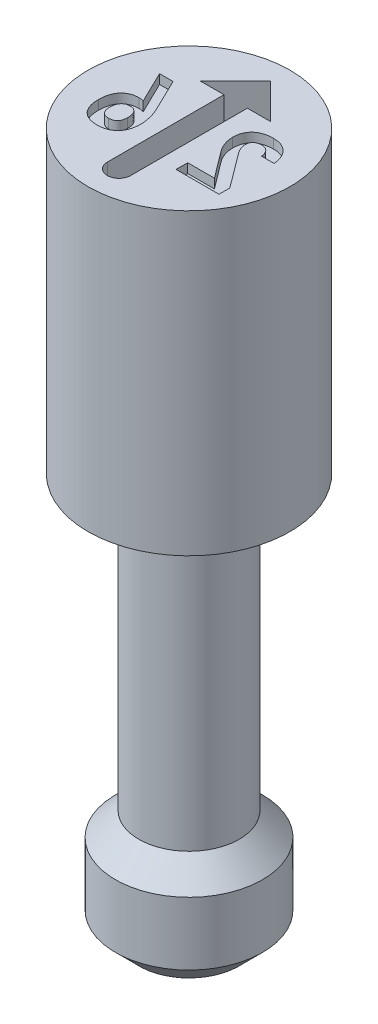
ISO-10303-21;
HEADER;
FILE_DESCRIPTION(('STEP AP214'),'2;1');
FILE_NAME('part.step','',(''),(''),'','','');
FILE_SCHEMA(('AUTOMOTIVE_DESIGN { 1 0 10303 214 1 1 1 1 }'));
ENDSEC;
DATA;
#1=APPLICATION_CONTEXT('core data for automotive mechanical design processes');
#2=APPLICATION_PROTOCOL_DEFINITION('international standard','automotive_design',2000,#1);
#3=PRODUCT_CONTEXT('',#1,'mechanical');
#4=PRODUCT('Part','Part','',(#3));
#5=PRODUCT_RELATED_PRODUCT_CATEGORY('part','',(#4));
#6=PRODUCT_DEFINITION_FORMATION('','',#4);
#7=PRODUCT_DEFINITION_CONTEXT('part definition',#1,'design');
#8=PRODUCT_DEFINITION('design','',#6,#7);
#9=PRODUCT_DEFINITION_SHAPE('','',#8);
#10=(LENGTH_UNIT() NAMED_UNIT(*) SI_UNIT(.MILLI.,.METRE.));
#11=(NAMED_UNIT(*) PLANE_ANGLE_UNIT() SI_UNIT($,.RADIAN.));
#12=(NAMED_UNIT(*) SI_UNIT($,.STERADIAN.) SOLID_ANGLE_UNIT());
#13=UNCERTAINTY_MEASURE_WITH_UNIT(LENGTH_MEASURE(1.E-05),#10,'distance_accuracy_value','');
#14=(GEOMETRIC_REPRESENTATION_CONTEXT(3) GLOBAL_UNCERTAINTY_ASSIGNED_CONTEXT((#13)) GLOBAL_UNIT_ASSIGNED_CONTEXT((#10,
#11,#12)) REPRESENTATION_CONTEXT('',''));
#15=CARTESIAN_POINT('',(0.,0.,0.));
#16=DIRECTION('',(0.,0.,1.));
#17=DIRECTION('',(1.,0.,0.));
#18=AXIS2_PLACEMENT_3D('',#15,#16,#17);
#19=CARTESIAN_POINT('',(0.,7.62,0.));
#20=DIRECTION('',(0.,1.,0.));
#21=DIRECTION('',(0.,0.,1.));
#22=AXIS2_PLACEMENT_3D('',#19,#20,#21);
#23=PLANE('',#22);
#24=DIRECTION('',(1.,0.,0.));
#25=VECTOR('',#24,1.);
#26=CARTESIAN_POINT('',(0.316223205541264,7.62,0.4572));
#27=LINE('',#26,#25);
#28=CARTESIAN_POINT('',(0.316223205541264,7.62,0.4572));
#29=VERTEX_POINT('',#28);
#30=CARTESIAN_POINT('',(0.783814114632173,7.62,0.4572));
#31=VERTEX_POINT('',#30);
#32=EDGE_CURVE('E52',#29,#31,#27,.T.);
#33=ORIENTED_EDGE('',*,*,#32,.F.);
#34=DIRECTION('',(0.,0.,1.));
#35=VECTOR('',#34,1.);
#36=CARTESIAN_POINT('',(0.316223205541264,7.62,0.33052987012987));
#37=LINE('',#36,#35);
#38=CARTESIAN_POINT('',(0.316223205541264,7.62,0.33052987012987));
#39=VERTEX_POINT('',#38);
#40=EDGE_CURVE('E315',#39,#29,#37,.T.);
#41=ORIENTED_EDGE('',*,*,#40,.F.);
#42=DIRECTION('',(-1.,0.,0.));
#43=VECTOR('',#42,1.);
#44=CARTESIAN_POINT('',(0.607333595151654,7.62,0.33052987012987));
#45=LINE('',#44,#43);
#46=CARTESIAN_POINT('',(0.607333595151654,7.62,0.33052987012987));
#47=VERTEX_POINT('',#46);
#48=EDGE_CURVE('E318',#47,#39,#45,.T.);
#49=ORIENTED_EDGE('',*,*,#48,.F.);
#50=DIRECTION('',(0.601464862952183,0.,0.798899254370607));
#51=VECTOR('',#50,1.);
#52=CARTESIAN_POINT('',(0.390773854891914,7.62,0.0428831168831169));
#53=LINE('',#52,#51);
#54=CARTESIAN_POINT('',(0.390773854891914,7.62,0.0428831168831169));
#55=VERTEX_POINT('',#54);
#56=EDGE_CURVE('E1393',#55,#47,#53,.T.);
#57=ORIENTED_EDGE('',*,*,#56,.F.);
#58=CARTESIAN_POINT('',(0.320676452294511,7.62,-0.15272987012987));
#59=CARTESIAN_POINT('',(0.320892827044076,7.62,-0.14441466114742));
#60=CARTESIAN_POINT('',(0.321327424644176,7.62,-0.12771322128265));
#61=CARTESIAN_POINT('',(0.325085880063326,7.62,-0.102584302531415));
#62=CARTESIAN_POINT('',(0.330513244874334,7.62,-0.0771943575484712));
#63=CARTESIAN_POINT('',(0.33876293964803,7.62,-0.0519096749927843));
#64=CARTESIAN_POINT('',(0.348698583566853,7.62,-0.0268740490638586));
#65=CARTESIAN_POINT('',(0.360812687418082,7.62,-0.00265805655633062));
#66=CARTESIAN_POINT('',(0.374637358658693,7.62,0.0208100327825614));
#67=CARTESIAN_POINT('',(0.385369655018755,7.62,0.0354907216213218));
#68=CARTESIAN_POINT('',(0.390773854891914,7.62,0.0428831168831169));
#69=B_SPLINE_CURVE_WITH_KNOTS('',3,(#58,#59,#60,#61,#62,#63,#64,#65,#66,#67,#68),.UNSPECIFIED.,
.F.,.F.,(4,1,1,1,1,1,1,1,4),(0.,0.117962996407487,0.236933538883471,0.360005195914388,
0.486119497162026,0.61393177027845,0.742012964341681,0.870091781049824,1.),.UNSPECIFIED.);
#70=CARTESIAN_POINT('',(0.320676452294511,7.62,-0.15272987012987));
#71=VERTEX_POINT('',#70);
#72=EDGE_CURVE('E1388',#71,#55,#69,.T.);
#73=ORIENTED_EDGE('',*,*,#72,.F.);
#74=DIRECTION('',(0.,0.,1.));
#75=VECTOR('',#74,1.);
#76=CARTESIAN_POINT('',(0.320676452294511,7.62,-0.153224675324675));
#77=LINE('',#76,#75);
#78=CARTESIAN_POINT('',(0.320676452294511,7.62,-0.153224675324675));
#79=VERTEX_POINT('',#78);
#80=EDGE_CURVE('E1382',#79,#71,#77,.T.);
#81=ORIENTED_EDGE('',*,*,#80,.F.);
#82=CARTESIAN_POINT('',(0.554389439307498,7.62,-0.366155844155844));
#83=CARTESIAN_POINT('',(0.545310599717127,7.62,-0.366023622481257));
#84=CARTESIAN_POINT('',(0.527661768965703,7.62,-0.365766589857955));
#85=CARTESIAN_POINT('',(0.502033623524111,7.62,-0.363031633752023));
#86=CARTESIAN_POINT('',(0.47796178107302,7.62,-0.358831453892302));
#87=CARTESIAN_POINT('',(0.455466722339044,7.62,-0.352765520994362));
#88=CARTESIAN_POINT('',(0.434593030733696,7.62,-0.344832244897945));
#89=CARTESIAN_POINT('',(0.415321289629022,7.62,-0.335199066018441));
#90=CARTESIAN_POINT('',(0.397525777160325,7.62,-0.324006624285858));
#91=CARTESIAN_POINT('',(0.381470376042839,7.62,-0.31087541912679));
#92=CARTESIAN_POINT('',(0.367132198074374,7.62,-0.29622594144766));
#93=CARTESIAN_POINT('',(0.354587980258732,7.62,-0.280112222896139));
#94=CARTESIAN_POINT('',(0.344233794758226,7.62,-0.262394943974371));
#95=CARTESIAN_POINT('',(0.335329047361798,7.62,-0.243431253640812));
#96=CARTESIAN_POINT('',(0.328883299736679,7.62,-0.222809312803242));
#97=CARTESIAN_POINT('',(0.324031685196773,7.62,-0.200915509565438));
#98=CARTESIAN_POINT('',(0.321255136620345,7.62,-0.177541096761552));
#99=CARTESIAN_POINT('',(0.320872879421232,7.61999999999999,-0.161478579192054));
#100=CARTESIAN_POINT('',(0.320676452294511,7.62,-0.153224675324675));
#101=B_SPLINE_CURVE_WITH_KNOTS('',3,(#82,#83,#84,#85,#86,#87,#88,#89,#90,#91,#92,#93,#94,#95,
#96,#97,#98,#99,#100),.UNSPECIFIED.,.F.,.F.,(4,1,1,1,1,1,1,1,1,1,1,1,1,1,1,1,4),(0.,
0.0757177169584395,0.147191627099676,0.214761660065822,0.279410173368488,0.341256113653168,
0.400743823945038,0.458895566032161,0.516277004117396,0.573364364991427,0.62960517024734,
0.686164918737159,0.744246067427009,0.804009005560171,0.865999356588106,0.931142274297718,1.),.UNSPECIFIED.);
#102=CARTESIAN_POINT('',(0.554389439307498,7.62,-0.366155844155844));
#103=VERTEX_POINT('',#102);
#104=EDGE_CURVE('E1374',#103,#79,#101,.T.);
#105=ORIENTED_EDGE('',*,*,#104,.F.);
#106=CARTESIAN_POINT('',(0.793710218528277,7.62,-0.133432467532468));
#107=CARTESIAN_POINT('',(0.792655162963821,7.62,-0.142473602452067));
#108=CARTESIAN_POINT('',(0.79059588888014,7.62,-0.160120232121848));
#109=CARTESIAN_POINT('',(0.784994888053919,7.62,-0.185549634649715));
#110=CARTESIAN_POINT('',(0.778141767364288,7.62,-0.209463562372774));
#111=CARTESIAN_POINT('',(0.769556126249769,7.62,-0.23183055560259));
#112=CARTESIAN_POINT('',(0.759310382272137,7.62,-0.252618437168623));
#113=CARTESIAN_POINT('',(0.74763335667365,7.62,-0.271980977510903));
#114=CARTESIAN_POINT('',(0.733942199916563,7.62,-0.289452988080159));
#115=CARTESIAN_POINT('',(0.719002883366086,7.62,-0.305556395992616));
#116=CARTESIAN_POINT('',(0.702432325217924,7.62,-0.319709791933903));
#117=CARTESIAN_POINT('',(0.684711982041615,7.62,-0.332152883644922));
#118=CARTESIAN_POINT('',(0.665845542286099,7.62,-0.342776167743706));
#119=CARTESIAN_POINT('',(0.645771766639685,7.62,-0.351392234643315));
#120=CARTESIAN_POINT('',(0.624521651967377,7.62,-0.357950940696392));
#121=CARTESIAN_POINT('',(0.602179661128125,7.62,-0.362763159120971));
#122=CARTESIAN_POINT('',(0.578651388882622,7.62,-0.365569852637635));
#123=CARTESIAN_POINT('',(0.562588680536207,7.62,-0.365957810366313));
#124=CARTESIAN_POINT('',(0.554389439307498,7.62,-0.366155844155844));
#125=B_SPLINE_CURVE_WITH_KNOTS('',3,(#106,#107,#108,#109,#110,#111,#112,#113,#114,#115,#116,
#117,#118,#119,#120,#121,#122,#123,#124),.UNSPECIFIED.,.F.,.F.,(4,1,1,1,1,1,1,1,1,1,1,1,1,1,1,1,
4),(0.,0.0735286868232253,0.143514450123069,0.210169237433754,0.274454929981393,
0.336856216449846,0.397291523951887,0.456843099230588,0.515945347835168,0.574554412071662,
0.632618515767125,0.690713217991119,0.749236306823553,0.808827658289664,0.870185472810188,
0.9337359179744,1.),.UNSPECIFIED.);
#126=CARTESIAN_POINT('',(0.793710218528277,7.62,-0.133432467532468));
#127=VERTEX_POINT('',#126);
#128=EDGE_CURVE('E1369',#127,#103,#125,.T.);
#129=ORIENTED_EDGE('',*,*,#128,.F.);
#130=DIRECTION('',(0.,0.,-1.));
#131=VECTOR('',#130,1.);
#132=CARTESIAN_POINT('',(0.793710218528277,7.62,-0.132937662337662));
#133=LINE('',#132,#131);
#134=CARTESIAN_POINT('',(0.793710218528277,7.62,-0.132937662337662));
#135=VERTEX_POINT('',#134);
#136=EDGE_CURVE('E1366',#135,#127,#133,.T.);
#137=ORIENTED_EDGE('',*,*,#136,.F.);
#138=DIRECTION('',(1.,0.,0.));
#139=VECTOR('',#138,1.);
#140=CARTESIAN_POINT('',(0.656814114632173,7.62,-0.132937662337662));
#141=LINE('',#140,#139);
#142=CARTESIAN_POINT('',(0.656814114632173,7.62,-0.132937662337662));
#143=VERTEX_POINT('',#142);
#144=EDGE_CURVE('E1363',#143,#135,#141,.T.);
#145=ORIENTED_EDGE('',*,*,#144,.F.);
#146=DIRECTION('',(0.,0.,1.));
#147=VECTOR('',#146,1.);
#148=CARTESIAN_POINT('',(0.656814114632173,7.62,-0.133432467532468));
#149=LINE('',#148,#147);
#150=CARTESIAN_POINT('',(0.656814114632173,7.62,-0.133432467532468));
#151=VERTEX_POINT('',#150);
#152=EDGE_CURVE('E1357',#151,#143,#149,.T.);
#153=ORIENTED_EDGE('',*,*,#152,.F.);
#154=CARTESIAN_POINT('',(0.553234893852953,7.62,-0.239485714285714));
#155=CARTESIAN_POINT('',(0.560094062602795,7.62,-0.239229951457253));
#156=CARTESIAN_POINT('',(0.573375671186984,7.62,-0.238734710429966));
#157=CARTESIAN_POINT('',(0.592228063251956,7.62,-0.233139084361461));
#158=CARTESIAN_POINT('',(0.609319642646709,7.62,-0.224541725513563));
#159=CARTESIAN_POINT('',(0.624047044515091,7.62,-0.212118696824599));
#160=CARTESIAN_POINT('',(0.636425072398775,7.62,-0.196633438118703));
#161=CARTESIAN_POINT('',(0.646237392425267,7.62,-0.178206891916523));
#162=CARTESIAN_POINT('',(0.653107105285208,7.62,-0.15678642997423));
#163=CARTESIAN_POINT('',(0.655541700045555,7.62,-0.141448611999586));
#164=CARTESIAN_POINT('',(0.656814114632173,7.62,-0.133432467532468));
#165=B_SPLINE_CURVE_WITH_KNOTS('',3,(#154,#155,#156,#157,#158,#159,#160,#161,#162,#163,#164),
.UNSPECIFIED.,.F.,.F.,(4,1,1,1,1,1,1,1,4),(0.,0.124986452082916,0.242014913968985,
0.3561482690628,0.472436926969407,0.591058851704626,0.716468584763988,0.851815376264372,1.),.UNSPECIFIED.);
#166=CARTESIAN_POINT('',(0.553234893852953,7.62,-0.239485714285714));
#167=VERTEX_POINT('',#166);
#168=EDGE_CURVE('E1349',#167,#151,#165,.T.);
#169=ORIENTED_EDGE('',*,*,#168,.F.);
#170=CARTESIAN_POINT('',(0.45806736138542,7.62,-0.153224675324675));
#171=CARTESIAN_POINT('',(0.458289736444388,7.62,-0.159747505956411));
#172=CARTESIAN_POINT('',(0.458714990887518,7.62,-0.172221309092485));
#173=CARTESIAN_POINT('',(0.463647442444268,7.62,-0.189681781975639));
#174=CARTESIAN_POINT('',(0.471487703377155,7.62,-0.204874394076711));
#175=CARTESIAN_POINT('',(0.482667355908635,7.62,-0.217445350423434));
#176=CARTESIAN_POINT('',(0.496576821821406,7.62,-0.227449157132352));
#177=CARTESIAN_POINT('',(0.51319509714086,7.62,-0.234666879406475));
#178=CARTESIAN_POINT('',(0.532432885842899,7.62,-0.238644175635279));
#179=CARTESIAN_POINT('',(0.546069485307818,7.62,-0.239195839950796));
#180=CARTESIAN_POINT('',(0.553234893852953,7.62,-0.239485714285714));
#181=B_SPLINE_CURVE_WITH_KNOTS('',3,(#170,#171,#172,#173,#174,#175,#176,#177,#178,#179,#180),
.UNSPECIFIED.,.F.,.F.,(4,1,1,1,1,1,1,1,4),(0.,0.133827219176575,0.255921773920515,
0.369738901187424,0.482715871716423,0.598532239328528,0.719553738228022,0.852638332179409,1.),.UNSPECIFIED.);
#182=CARTESIAN_POINT('',(0.45806736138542,7.62,-0.153224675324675));
#183=VERTEX_POINT('',#182);
#184=EDGE_CURVE('E1344',#183,#167,#181,.T.);
#185=ORIENTED_EDGE('',*,*,#184,.F.);
#186=DIRECTION('',(0.,0.,-1.));
#187=VECTOR('',#186,1.);
#188=CARTESIAN_POINT('',(0.45806736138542,7.62,-0.15207012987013));
#189=LINE('',#188,#187);
#190=CARTESIAN_POINT('',(0.45806736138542,7.62,-0.15207012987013));
#191=VERTEX_POINT('',#190);
#192=EDGE_CURVE('E1338',#191,#183,#189,.T.);
#193=ORIENTED_EDGE('',*,*,#192,.F.);
#194=CARTESIAN_POINT('',(0.503754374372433,7.62,-0.035461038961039));
#195=CARTESIAN_POINT('',(0.500288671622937,7.62,-0.0402595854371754));
#196=CARTESIAN_POINT('',(0.493454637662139,7.62,-0.0497218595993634));
#197=CARTESIAN_POINT('',(0.48430969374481,7.62,-0.0644336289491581));
#198=CARTESIAN_POINT('',(0.47660604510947,7.62,-0.0794885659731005));
#199=CARTESIAN_POINT('',(0.469962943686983,7.62,-0.0946085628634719));
#200=CARTESIAN_POINT('',(0.464759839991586,7.62,-0.109618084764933));
#201=CARTESIAN_POINT('',(0.46082874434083,7.62,-0.124199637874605));
#202=CARTESIAN_POINT('',(0.458660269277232,7.62,-0.138315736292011));
#203=CARTESIAN_POINT('',(0.458261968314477,7.62,-0.147555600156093));
#204=CARTESIAN_POINT('',(0.45806736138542,7.62,-0.15207012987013));
#205=B_SPLINE_CURVE_WITH_KNOTS('',3,(#194,#195,#196,#197,#198,#199,#200,#201,#202,#203,#204),
.UNSPECIFIED.,.F.,.F.,(4,1,1,1,1,1,1,1,4),(0.,0.139527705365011,0.275135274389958,
0.407888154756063,0.537917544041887,0.66417107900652,0.782063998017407,0.893518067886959,1.),.UNSPECIFIED.);
#206=CARTESIAN_POINT('',(0.503754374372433,7.62,-0.035461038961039));
#207=VERTEX_POINT('',#206);
#208=EDGE_CURVE('E1333',#207,#191,#205,.T.);
#209=ORIENTED_EDGE('',*,*,#208,.F.);
#210=DIRECTION('',(-0.597969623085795,0.,-0.801518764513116));
#211=VECTOR('',#210,1.);
#212=CARTESIAN_POINT('',(0.783814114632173,7.62,0.339931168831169));
#213=LINE('',#212,#211);
#214=CARTESIAN_POINT('',(0.783814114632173,7.62,0.339931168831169));
#215=VERTEX_POINT('',#214);
#216=EDGE_CURVE('E1330',#215,#207,#213,.T.);
#217=ORIENTED_EDGE('',*,*,#216,.F.);
#218=DIRECTION('',(0.,0.,-1.));
#219=VECTOR('',#218,1.);
#220=CARTESIAN_POINT('',(0.783814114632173,7.62,0.4572));
#221=LINE('',#220,#219);
#222=EDGE_CURVE('E1328',#31,#215,#221,.T.);
#223=ORIENTED_EDGE('',*,*,#222,.F.);
#224=EDGE_LOOP('',(#33,#41,#49,#57,#73,#81,#105,#129,#137,#145,#153,#169,#185,#193,#209,#217,#223));
#225=FACE_BOUND('',#224,.T.);
#226=CARTESIAN_POINT('',(-0.764794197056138,7.62,0.222497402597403));
#227=CARTESIAN_POINT('',(-0.764603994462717,7.62,0.231961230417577));
#228=CARTESIAN_POINT('',(-0.76423377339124,7.62,0.250382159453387));
#229=CARTESIAN_POINT('',(-0.761372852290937,7.62,0.277176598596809));
#230=CARTESIAN_POINT('',(-0.756856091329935,7.62,0.302364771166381));
#231=CARTESIAN_POINT('',(-0.750268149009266,7.62,0.325910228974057));
#232=CARTESIAN_POINT('',(-0.741671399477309,7.62,0.347783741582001));
#233=CARTESIAN_POINT('',(-0.731194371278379,7.62,0.368043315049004));
#234=CARTESIAN_POINT('',(-0.719053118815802,7.62,0.386820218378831));
#235=CARTESIAN_POINT('',(-0.704755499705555,7.62,0.403659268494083));
#236=CARTESIAN_POINT('',(-0.688832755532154,7.62,0.418761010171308));
#237=CARTESIAN_POINT('',(-0.67131951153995,7.62,0.432064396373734));
#238=CARTESIAN_POINT('',(-0.652099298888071,7.62,0.443091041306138));
#239=CARTESIAN_POINT('',(-0.631330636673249,7.62,0.452080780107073));
#240=CARTESIAN_POINT('',(-0.609057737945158,7.62,0.459128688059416));
#241=CARTESIAN_POINT('',(-0.585156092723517,7.62,0.464262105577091));
#242=CARTESIAN_POINT('',(-0.559689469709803,7.62,0.467210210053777));
#243=CARTESIAN_POINT('',(-0.54219450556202,7.62,0.467570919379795));
#244=CARTESIAN_POINT('',(-0.533225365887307,7.62,0.467755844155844));
#245=B_SPLINE_CURVE_WITH_KNOTS('',3,(#226,#227,#228,#229,#230,#231,#232,#233,#234,#235,#236,
#237,#238,#239,#240,#241,#242,#243,#244),.UNSPECIFIED.,.F.,.F.,(4,1,1,1,1,1,1,1,1,1,1,1,1,1,1,1,
4),(0.,0.0739861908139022,0.144010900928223,0.210453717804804,0.273873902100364,
0.334863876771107,0.393890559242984,0.451957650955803,0.50931223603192,0.5661765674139,
0.623266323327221,0.680854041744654,0.738995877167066,0.799903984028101,0.863226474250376,
0.929880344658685,1.),.UNSPECIFIED.);
#246=CARTESIAN_POINT('',(-0.764794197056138,7.62,0.222497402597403));
#247=VERTEX_POINT('',#246);
#248=CARTESIAN_POINT('',(-0.533225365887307,7.62,0.467755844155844));
#249=VERTEX_POINT('',#248);
#250=EDGE_CURVE('E60',#247,#249,#245,.T.);
#251=ORIENTED_EDGE('',*,*,#250,.F.);
#252=DIRECTION('',(0.,0.,1.));
#253=VECTOR('',#252,1.);
#254=CARTESIAN_POINT('',(-0.764794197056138,7.62,0.222002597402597));
#255=LINE('',#254,#253);
#256=CARTESIAN_POINT('',(-0.764794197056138,7.62,0.222002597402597));
#257=VERTEX_POINT('',#256);
#258=EDGE_CURVE('E436',#257,#247,#255,.T.);
#259=ORIENTED_EDGE('',*,*,#258,.F.);
#260=CARTESIAN_POINT('',(-0.559450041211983,7.62,-0.017812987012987));
#261=CARTESIAN_POINT('',(-0.567323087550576,7.62,-0.0176364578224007));
#262=CARTESIAN_POINT('',(-0.582742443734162,7.62,-0.0172907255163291));
#263=CARTESIAN_POINT('',(-0.605139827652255,7.62,-0.0141997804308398));
#264=CARTESIAN_POINT('',(-0.626281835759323,7.62,-0.0096073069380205));
#265=CARTESIAN_POINT('',(-0.645872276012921,7.62,-0.00246084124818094));
#266=CARTESIAN_POINT('',(-0.664349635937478,7.62,0.00612455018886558));
#267=CARTESIAN_POINT('',(-0.68121199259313,7.62,0.0172119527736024));
#268=CARTESIAN_POINT('',(-0.69687830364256,7.62,0.0299634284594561));
#269=CARTESIAN_POINT('',(-0.711073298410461,7.62,0.0447175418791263));
#270=CARTESIAN_POINT('',(-0.723789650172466,7.62,0.0612571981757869));
#271=CARTESIAN_POINT('',(-0.734865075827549,7.62,0.0794452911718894));
#272=CARTESIAN_POINT('',(-0.744122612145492,7.62,0.0992698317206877));
#273=CARTESIAN_POINT('',(-0.751738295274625,7.62,0.120698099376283));
#274=CARTESIAN_POINT('',(-0.757583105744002,7.62,0.143791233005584));
#275=CARTESIAN_POINT('',(-0.761884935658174,7.62,0.168428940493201));
#276=CARTESIAN_POINT('',(-0.764349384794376,7.62,0.194682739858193));
#277=CARTESIAN_POINT('',(-0.764642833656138,7.62,0.212706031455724));
#278=CARTESIAN_POINT('',(-0.764794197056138,7.62,0.222002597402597));
#279=B_SPLINE_CURVE_WITH_KNOTS('',3,(#260,#261,#262,#263,#264,#265,#266,#267,#268,#269,#270,
#271,#272,#273,#274,#275,#276,#277,#278),.UNSPECIFIED.,.F.,.F.,(4,1,1,1,1,1,1,1,1,1,1,1,1,1,1,1,
4),(0.,0.0658754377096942,0.129017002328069,0.188974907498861,0.246623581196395,
0.303237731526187,0.359155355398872,0.415082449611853,0.472045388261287,0.530135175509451,
0.589416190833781,0.649949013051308,0.712984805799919,0.779517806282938,0.849133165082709,
0.922181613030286,1.),.UNSPECIFIED.);
#280=CARTESIAN_POINT('',(-0.559450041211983,7.62,-0.017812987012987));
#281=VERTEX_POINT('',#280);
#282=EDGE_CURVE('E615',#281,#257,#279,.T.);
#283=ORIENTED_EDGE('',*,*,#282,.F.);
#284=CARTESIAN_POINT('',(-0.456365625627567,7.62,0.0367805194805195));
#285=CARTESIAN_POINT('',(-0.458864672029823,7.62,0.0323961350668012));
#286=CARTESIAN_POINT('',(-0.46376398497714,7.62,0.0238006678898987));
#287=CARTESIAN_POINT('',(-0.473412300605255,7.62,0.0127077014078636));
#288=CARTESIAN_POINT('',(-0.484176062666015,7.62,0.00309956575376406));
#289=CARTESIAN_POINT('',(-0.496615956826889,7.62,-0.00452100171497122));
#290=CARTESIAN_POINT('',(-0.510404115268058,7.62,-0.0104592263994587));
#291=CARTESIAN_POINT('',(-0.525545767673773,7.62,-0.0147013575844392));
#292=CARTESIAN_POINT('',(-0.542033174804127,7.62,-0.0174374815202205));
#293=CARTESIAN_POINT('',(-0.55350077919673,7.62,-0.017684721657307));
#294=CARTESIAN_POINT('',(-0.559450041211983,7.62,-0.017812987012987));
#295=B_SPLINE_CURVE_WITH_KNOTS('',3,(#284,#285,#286,#287,#288,#289,#290,#291,#292,#293,#294),
.UNSPECIFIED.,.F.,.F.,(4,1,1,1,1,1,1,1,4),(0.,0.122662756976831,0.240477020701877,
0.356264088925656,0.472961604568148,0.594130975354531,0.720885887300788,0.855198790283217,1.),.UNSPECIFIED.);
#296=CARTESIAN_POINT('',(-0.507259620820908,7.62,-0.00893156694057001));
#297=VERTEX_POINT('',#296);
#298=EDGE_CURVE('E620',#297,#281,#295,.T.);
#299=ORIENTED_EDGE('',*,*,#298,.F.);
#300=DIRECTION('',(0.438125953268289,0.,0.898913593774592));
#301=VECTOR('',#300,1.);
#302=CARTESIAN_POINT('',(-0.676224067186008,7.62,-0.3556));
#303=LINE('',#302,#301);
#304=CARTESIAN_POINT('',(-0.676224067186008,7.62,-0.3556));
#305=VERTEX_POINT('',#304);
#306=EDGE_CURVE('E628',#305,#297,#303,.T.);
#307=ORIENTED_EDGE('',*,*,#306,.F.);
#308=DIRECTION('',(-1.,0.,0.));
#309=VECTOR('',#308,1.);
#310=CARTESIAN_POINT('',(-0.528772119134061,7.62,-0.3556));
#311=LINE('',#310,#309);
#312=CARTESIAN_POINT('',(-0.528772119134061,7.62,-0.3556));
#313=VERTEX_POINT('',#312);
#314=EDGE_CURVE('E634',#313,#305,#311,.T.);
#315=ORIENTED_EDGE('',*,*,#314,.F.);
#316=DIRECTION('',(-0.436864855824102,0.,-0.899527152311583));
#317=VECTOR('',#316,1.);
#318=CARTESIAN_POINT('',(-0.358394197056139,7.62,-0.00478311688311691));
#319=LINE('',#318,#317);
#320=CARTESIAN_POINT('',(-0.358394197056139,7.62,-0.00478311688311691));
#321=VERTEX_POINT('',#320);
#322=EDGE_CURVE('E637',#321,#313,#319,.T.);
#323=ORIENTED_EDGE('',*,*,#322,.F.);
#324=CARTESIAN_POINT('',(-0.302151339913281,7.62,0.221177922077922));
#325=CARTESIAN_POINT('',(-0.302378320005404,7.62,0.212266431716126));
#326=CARTESIAN_POINT('',(-0.30284019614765,7.62,0.194132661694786));
#327=CARTESIAN_POINT('',(-0.305494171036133,7.62,0.166568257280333));
#328=CARTESIAN_POINT('',(-0.31023259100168,7.62,0.138287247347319));
#329=CARTESIAN_POINT('',(-0.316567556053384,7.62,0.109406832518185));
#330=CARTESIAN_POINT('',(-0.324915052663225,7.62,0.08041320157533));
#331=CARTESIAN_POINT('',(-0.334350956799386,7.62,0.0514860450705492));
#332=CARTESIAN_POINT('',(-0.345653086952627,7.62,0.0230888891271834));
#333=CARTESIAN_POINT('',(-0.354137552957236,7.62,0.00452856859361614));
#334=CARTESIAN_POINT('',(-0.358394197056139,7.62,-0.00478311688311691));
#335=B_SPLINE_CURVE_WITH_KNOTS('',3,(#324,#325,#326,#327,#328,#329,#330,#331,#332,#333,#334),
.UNSPECIFIED.,.F.,.F.,(4,1,1,1,1,1,1,1,4),(0.,0.1139317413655,0.231836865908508,
0.353616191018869,0.480309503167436,0.609573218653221,0.73914226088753,0.86912805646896,1.),.UNSPECIFIED.);
#336=CARTESIAN_POINT('',(-0.302151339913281,7.62,0.221177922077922));
#337=VERTEX_POINT('',#336);
#338=EDGE_CURVE('E640',#337,#321,#335,.T.);
#339=ORIENTED_EDGE('',*,*,#338,.F.);
#340=DIRECTION('',(0.,0.,-1.));
#341=VECTOR('',#340,1.);
#342=CARTESIAN_POINT('',(-0.302151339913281,7.62,0.221672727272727));
#343=LINE('',#342,#341);
#344=CARTESIAN_POINT('',(-0.302151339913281,7.62,0.221672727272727));
#345=VERTEX_POINT('',#344);
#346=EDGE_CURVE('E645',#345,#337,#343,.T.);
#347=ORIENTED_EDGE('',*,*,#346,.F.);
#348=CARTESIAN_POINT('',(-0.533225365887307,7.62,0.467755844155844));
#349=CARTESIAN_POINT('',(-0.524310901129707,7.62,0.467573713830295));
#350=CARTESIAN_POINT('',(-0.506979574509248,7.62,0.467219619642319));
#351=CARTESIAN_POINT('',(-0.481734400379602,7.62,0.464248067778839));
#352=CARTESIAN_POINT('',(-0.458052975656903,7.62,0.45912367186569));
#353=CARTESIAN_POINT('',(-0.435863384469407,7.62,0.452081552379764));
#354=CARTESIAN_POINT('',(-0.415236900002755,7.62,0.442947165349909));
#355=CARTESIAN_POINT('',(-0.396144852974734,7.62,0.431840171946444));
#356=CARTESIAN_POINT('',(-0.378502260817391,7.62,0.41872420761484));
#357=CARTESIAN_POINT('',(-0.362503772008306,7.62,0.403546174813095));
#358=CARTESIAN_POINT('',(-0.348356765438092,7.62,0.386467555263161));
#359=CARTESIAN_POINT('',(-0.335784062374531,7.62,0.367887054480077));
#360=CARTESIAN_POINT('',(-0.325467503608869,7.62,0.347431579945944));
#361=CARTESIAN_POINT('',(-0.3168535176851,7.62,0.325466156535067));
#362=CARTESIAN_POINT('',(-0.310280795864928,7.62,0.301799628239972));
#363=CARTESIAN_POINT('',(-0.305531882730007,7.62,0.276589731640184));
#364=CARTESIAN_POINT('',(-0.302718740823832,7.62,0.24966523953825));
#365=CARTESIAN_POINT('',(-0.302344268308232,7.62,0.23119077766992));
#366=CARTESIAN_POINT('',(-0.302151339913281,7.62,0.221672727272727));
#367=B_SPLINE_CURVE_WITH_KNOTS('',3,(#348,#349,#350,#351,#352,#353,#354,#355,#356,#357,#358,
#359,#360,#361,#362,#363,#364,#365,#366),.UNSPECIFIED.,.F.,.F.,(4,1,1,1,1,1,1,1,1,1,1,1,1,1,1,1,
4),(0.,0.0696928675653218,0.13549549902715,0.198400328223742,0.258901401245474,
0.317218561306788,0.374436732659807,0.431270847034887,0.488745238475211,0.546431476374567,
0.604379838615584,0.663791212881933,0.725183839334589,0.788606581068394,0.855553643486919,
0.925581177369,1.),.UNSPECIFIED.);
#368=EDGE_CURVE('E651',#249,#345,#367,.T.);
#369=ORIENTED_EDGE('',*,*,#368,.F.);
#370=EDGE_LOOP('',(#251,#259,#283,#299,#307,#315,#323,#339,#347,#369));
#371=FACE_BOUND('',#370,.T.);
#372=CARTESIAN_POINT('',(0.,7.62,0.762));
#373=DIRECTION('',(0.,1.,0.));
#374=DIRECTION('',(0.,0.,1.));
#375=AXIS2_PLACEMENT_3D('',#372,#373,#374);
#376=CIRCLE('',#375,0.127);
#377=CARTESIAN_POINT('',(-0.127,7.62,0.762));
#378=VERTEX_POINT('',#377);
#379=CARTESIAN_POINT('',(0.127,7.62,0.762));
#380=VERTEX_POINT('',#379);
#381=EDGE_CURVE('E570',#378,#380,#376,.T.);
#382=ORIENTED_EDGE('',*,*,#381,.F.);
#383=DIRECTION('',(0.,0.,1.));
#384=VECTOR('',#383,1.);
#385=CARTESIAN_POINT('',(-0.127,7.62,0.762));
#386=LINE('',#385,#384);
#387=CARTESIAN_POINT('',(-0.127,7.62,-0.508));
#388=VERTEX_POINT('',#387);
#389=EDGE_CURVE('E551',#388,#378,#386,.T.);
#390=ORIENTED_EDGE('',*,*,#389,.F.);
#391=DIRECTION('',(1.,0.,0.));
#392=VECTOR('',#391,1.);
#393=CARTESIAN_POINT('',(-0.127,7.62,-0.508));
#394=LINE('',#393,#392);
#395=CARTESIAN_POINT('',(-0.381,7.62,-0.508));
#396=VERTEX_POINT('',#395);
#397=EDGE_CURVE('E555',#396,#388,#394,.T.);
#398=ORIENTED_EDGE('',*,*,#397,.F.);
#399=DIRECTION('',(-0.707106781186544,0.,0.707106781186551));
#400=VECTOR('',#399,1.);
#401=CARTESIAN_POINT('',(0.,7.62,-0.889000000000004));
#402=LINE('',#401,#400);
#403=CARTESIAN_POINT('',(0.,7.62,-0.889000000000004));
#404=VERTEX_POINT('',#403);
#405=EDGE_CURVE('E558',#404,#396,#402,.T.);
#406=ORIENTED_EDGE('',*,*,#405,.F.);
#407=DIRECTION('',(-0.707106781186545,0.,-0.70710678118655));
#408=VECTOR('',#407,1.);
#409=CARTESIAN_POINT('',(0.381,7.62,-0.508000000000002));
#410=LINE('',#409,#408);
#411=CARTESIAN_POINT('',(0.381,7.62,-0.508000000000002));
#412=VERTEX_POINT('',#411);
#413=EDGE_CURVE('E561',#412,#404,#410,.T.);
#414=ORIENTED_EDGE('',*,*,#413,.F.);
#415=DIRECTION('',(1.,0.,0.));
#416=VECTOR('',#415,1.);
#417=CARTESIAN_POINT('',(0.127,7.62,-0.508));
#418=LINE('',#417,#416);
#419=CARTESIAN_POINT('',(0.127,7.62,-0.508));
#420=VERTEX_POINT('',#419);
#421=EDGE_CURVE('E564',#420,#412,#418,.T.);
#422=ORIENTED_EDGE('',*,*,#421,.F.);
#423=DIRECTION('',(0.,0.,-1.));
#424=VECTOR('',#423,1.);
#425=CARTESIAN_POINT('',(0.127,7.62,0.762));
#426=LINE('',#425,#424);
#427=EDGE_CURVE('E567',#380,#420,#426,.T.);
#428=ORIENTED_EDGE('',*,*,#427,.F.);
#429=EDGE_LOOP('',(#382,#390,#398,#406,#414,#422,#428));
#430=FACE_BOUND('',#429,.T.);
#431=CARTESIAN_POINT('',(0.,7.62,0.));
#432=DIRECTION('',(0.,-1.,0.));
#433=DIRECTION('',(0.,0.,-1.));
#434=AXIS2_PLACEMENT_3D('',#431,#432,#433);
#435=CIRCLE('',#434,1.09855);
#436=CARTESIAN_POINT('',(0.,7.62,-1.09855));
#437=VERTEX_POINT('',#436);
#438=EDGE_CURVE('E11',#437,#437,#435,.T.);
#439=ORIENTED_EDGE('',*,*,#438,.F.);
#440=EDGE_LOOP('',(#439));
#441=FACE_BOUND('',#440,.T.);
#442=ADVANCED_FACE('F37',(#225,#371,#430,#441),#23,.T.);
#443=CARTESIAN_POINT('',(0.,0.,0.));
#444=DIRECTION('',(0.,-1.,0.));
#445=DIRECTION('',(0.,0.,-1.));
#446=AXIS2_PLACEMENT_3D('',#443,#444,#445);
#447=CYLINDRICAL_SURFACE('',#446,1.09855);
#448=ORIENTED_EDGE('',*,*,#438,.T.);
#449=EDGE_LOOP('',(#448));
#450=FACE_BOUND('',#449,.T.);
#451=CARTESIAN_POINT('',(0.,4.3688,0.));
#452=DIRECTION('',(0.,-1.,0.));
#453=DIRECTION('',(0.,0.,-1.));
#454=AXIS2_PLACEMENT_3D('',#451,#452,#453);
#455=CIRCLE('',#454,1.09855);
#456=CARTESIAN_POINT('',(0.,4.3688,-1.09855));
#457=VERTEX_POINT('',#456);
#458=EDGE_CURVE('E45',#457,#457,#455,.T.);
#459=ORIENTED_EDGE('',*,*,#458,.F.);
#460=EDGE_LOOP('',(#459));
#461=FACE_BOUND('',#460,.T.);
#462=ADVANCED_FACE('F507',(#450,#461),#447,.T.);
#463=CARTESIAN_POINT('',(1.09855,4.3688,0.));
#464=DIRECTION('',(0.,-1.,0.));
#465=DIRECTION('',(0.,0.,-1.));
#466=AXIS2_PLACEMENT_3D('',#463,#464,#465);
#467=PLANE('',#466);
#468=ORIENTED_EDGE('',*,*,#458,.T.);
#469=EDGE_LOOP('',(#468));
#470=FACE_BOUND('',#469,.T.);
#471=CARTESIAN_POINT('',(0.,4.3688,0.));
#472=DIRECTION('',(0.,-1.,0.));
#473=DIRECTION('',(0.,0.,-1.));
#474=AXIS2_PLACEMENT_3D('',#471,#472,#473);
#475=CIRCLE('',#474,0.5461);
#476=CARTESIAN_POINT('',(0.,4.3688,-0.5461));
#477=VERTEX_POINT('',#476);
#478=EDGE_CURVE('E519',#477,#477,#475,.T.);
#479=ORIENTED_EDGE('',*,*,#478,.F.);
#480=EDGE_LOOP('',(#479));
#481=FACE_BOUND('',#480,.T.);
#482=ADVANCED_FACE('F504',(#470,#481),#467,.T.);
#483=CARTESIAN_POINT('',(0.,0.,0.));
#484=DIRECTION('',(0.,-1.,0.));
#485=DIRECTION('',(0.,0.,-1.));
#486=AXIS2_PLACEMENT_3D('',#483,#484,#485);
#487=CYLINDRICAL_SURFACE('',#486,0.5461);
#488=ORIENTED_EDGE('',*,*,#478,.T.);
#489=EDGE_LOOP('',(#488));
#490=FACE_BOUND('',#489,.T.);
#491=CARTESIAN_POINT('',(0.,1.1938,0.));
#492=DIRECTION('',(0.,-1.,0.));
#493=DIRECTION('',(0.,0.,-1.));
#494=AXIS2_PLACEMENT_3D('',#491,#492,#493);
#495=CIRCLE('',#494,0.5461);
#496=CARTESIAN_POINT('',(0.,1.1938,-0.5461));
#497=VERTEX_POINT('',#496);
#498=EDGE_CURVE('E521',#497,#497,#495,.T.);
#499=ORIENTED_EDGE('',*,*,#498,.F.);
#500=EDGE_LOOP('',(#499));
#501=FACE_BOUND('',#500,.T.);
#502=ADVANCED_FACE('F500',(#490,#501),#487,.T.);
#503=CARTESIAN_POINT('',(0.,0.939900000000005,0.));
#504=DIRECTION('',(0.,-1.,0.));
#505=DIRECTION('',(0.,0.,-1.));
#506=AXIS2_PLACEMENT_3D('',#503,#504,#505);
#507=CONICAL_SURFACE('',#506,0.8,0.785398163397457);
#508=ORIENTED_EDGE('',*,*,#498,.T.);
#509=EDGE_LOOP('',(#508));
#510=FACE_BOUND('',#509,.T.);
#511=CARTESIAN_POINT('',(0.,0.939900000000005,0.));
#512=DIRECTION('',(0.,-1.,0.));
#513=DIRECTION('',(0.,0.,-1.));
#514=AXIS2_PLACEMENT_3D('',#511,#512,#513);
#515=CIRCLE('',#514,0.8);
#516=CARTESIAN_POINT('',(0.,0.939900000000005,-0.8));
#517=VERTEX_POINT('',#516);
#518=EDGE_CURVE('E526',#517,#517,#515,.T.);
#519=ORIENTED_EDGE('',*,*,#518,.F.);
#520=EDGE_LOOP('',(#519));
#521=FACE_BOUND('',#520,.T.);
#522=ADVANCED_FACE('F496',(#510,#521),#507,.T.);
#523=CARTESIAN_POINT('',(0.,0.,0.));
#524=DIRECTION('',(0.,-1.,0.));
#525=DIRECTION('',(0.,0.,-1.));
#526=AXIS2_PLACEMENT_3D('',#523,#524,#525);
#527=CYLINDRICAL_SURFACE('',#526,0.8);
#528=ORIENTED_EDGE('',*,*,#518,.T.);
#529=EDGE_LOOP('',(#528));
#530=FACE_BOUND('',#529,.T.);
#531=CARTESIAN_POINT('',(0.,0.254,0.));
#532=DIRECTION('',(0.,-1.,0.));
#533=DIRECTION('',(0.,0.,-1.));
#534=AXIS2_PLACEMENT_3D('',#531,#532,#533);
#535=CIRCLE('',#534,0.8);
#536=CARTESIAN_POINT('',(0.,0.254,-0.8));
#537=VERTEX_POINT('',#536);
#538=EDGE_CURVE('E529',#537,#537,#535,.T.);
#539=ORIENTED_EDGE('',*,*,#538,.F.);
#540=EDGE_LOOP('',(#539));
#541=FACE_BOUND('',#540,.T.);
#542=ADVANCED_FACE('F492',(#530,#541),#527,.T.);
#543=CARTESIAN_POINT('',(0.,0.,0.));
#544=DIRECTION('',(0.,1.,0.));
#545=DIRECTION('',(0.,0.,1.));
#546=AXIS2_PLACEMENT_3D('',#543,#544,#545);
#547=CONICAL_SURFACE('',#546,0.546000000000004,0.78539816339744);
#548=ORIENTED_EDGE('',*,*,#538,.T.);
#549=EDGE_LOOP('',(#548));
#550=FACE_BOUND('',#549,.T.);
#551=CARTESIAN_POINT('',(0.,0.,0.));
#552=DIRECTION('',(0.,-1.,0.));
#553=DIRECTION('',(0.,0.,-1.));
#554=AXIS2_PLACEMENT_3D('',#551,#552,#553);
#555=CIRCLE('',#554,0.546000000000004);
#556=CARTESIAN_POINT('',(0.,0.,-0.546000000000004));
#557=VERTEX_POINT('',#556);
#558=EDGE_CURVE('E532',#557,#557,#555,.T.);
#559=ORIENTED_EDGE('',*,*,#558,.F.);
#560=EDGE_LOOP('',(#559));
#561=FACE_BOUND('',#560,.T.);
#562=ADVANCED_FACE('F488',(#550,#561),#547,.T.);
#563=CARTESIAN_POINT('',(0.546000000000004,0.,0.));
#564=DIRECTION('',(0.,-1.,0.));
#565=DIRECTION('',(0.,0.,-1.));
#566=AXIS2_PLACEMENT_3D('',#563,#564,#565);
#567=PLANE('',#566);
#568=ORIENTED_EDGE('',*,*,#558,.T.);
#569=EDGE_LOOP('',(#568));
#570=FACE_BOUND('',#569,.T.);
#571=ADVANCED_FACE('F484',(#570),#567,.T.);
#572=CARTESIAN_POINT('',(0.,7.2136,0.762));
#573=DIRECTION('',(0.,1.,0.));
#574=DIRECTION('',(0.,0.,1.));
#575=AXIS2_PLACEMENT_3D('',#572,#573,#574);
#576=CYLINDRICAL_SURFACE('',#575,0.127);
#577=ORIENTED_EDGE('',*,*,#381,.T.);
#578=DIRECTION('',(0.,1.,0.));
#579=VECTOR('',#578,1.);
#580=CARTESIAN_POINT('',(0.127,7.2136,0.762));
#581=LINE('',#580,#579);
#582=CARTESIAN_POINT('',(0.127,7.2136,0.762));
#583=VERTEX_POINT('',#582);
#584=EDGE_CURVE('E536',#583,#380,#581,.T.);
#585=ORIENTED_EDGE('',*,*,#584,.F.);
#586=CARTESIAN_POINT('',(0.,7.2136,0.762));
#587=DIRECTION('',(0.,1.,0.));
#588=DIRECTION('',(0.,0.,1.));
#589=AXIS2_PLACEMENT_3D('',#586,#587,#588);
#590=CIRCLE('',#589,0.127);
#591=CARTESIAN_POINT('',(-0.127,7.2136,0.762));
#592=VERTEX_POINT('',#591);
#593=EDGE_CURVE('E554',#592,#583,#590,.T.);
#594=ORIENTED_EDGE('',*,*,#593,.F.);
#595=DIRECTION('',(0.,1.,0.));
#596=VECTOR('',#595,1.);
#597=CARTESIAN_POINT('',(-0.127,7.2136,0.762));
#598=LINE('',#597,#596);
#599=EDGE_CURVE('E535',#592,#378,#598,.T.);
#600=ORIENTED_EDGE('',*,*,#599,.T.);
#601=EDGE_LOOP('',(#577,#585,#594,#600));
#602=FACE_BOUND('',#601,.T.);
#603=ADVANCED_FACE('F462',(#602),#576,.F.);
#604=CARTESIAN_POINT('',(-0.127,7.2136,0.762));
#605=DIRECTION('',(-1.,0.,0.));
#606=DIRECTION('',(0.,0.,1.));
#607=AXIS2_PLACEMENT_3D('',#604,#605,#606);
#608=PLANE('',#607);
#609=ORIENTED_EDGE('',*,*,#389,.T.);
#610=ORIENTED_EDGE('',*,*,#599,.F.);
#611=DIRECTION('',(0.,0.,1.));
#612=VECTOR('',#611,1.);
#613=CARTESIAN_POINT('',(-0.127,7.2136,0.762));
#614=LINE('',#613,#612);
#615=CARTESIAN_POINT('',(-0.127,7.2136,-0.508));
#616=VERTEX_POINT('',#615);
#617=EDGE_CURVE('E540',#616,#592,#614,.T.);
#618=ORIENTED_EDGE('',*,*,#617,.F.);
#619=DIRECTION('',(0.,1.,0.));
#620=VECTOR('',#619,1.);
#621=CARTESIAN_POINT('',(-0.127,7.2136,-0.508));
#622=LINE('',#621,#620);
#623=EDGE_CURVE('E548',#616,#388,#622,.T.);
#624=ORIENTED_EDGE('',*,*,#623,.T.);
#625=EDGE_LOOP('',(#609,#610,#618,#624));
#626=FACE_BOUND('',#625,.T.);
#627=ADVANCED_FACE('F458',(#626),#608,.F.);
#628=CARTESIAN_POINT('',(-0.127,7.2136,-0.508));
#629=DIRECTION('',(0.,0.,1.));
#630=DIRECTION('',(1.,0.,0.));
#631=AXIS2_PLACEMENT_3D('',#628,#629,#630);
#632=PLANE('',#631);
#633=ORIENTED_EDGE('',*,*,#397,.T.);
#634=ORIENTED_EDGE('',*,*,#623,.F.);
#635=DIRECTION('',(1.,0.,0.));
#636=VECTOR('',#635,1.);
#637=CARTESIAN_POINT('',(-0.127,7.2136,-0.508));
#638=LINE('',#637,#636);
#639=CARTESIAN_POINT('',(-0.381,7.2136,-0.508));
#640=VERTEX_POINT('',#639);
#641=EDGE_CURVE('E575',#640,#616,#638,.T.);
#642=ORIENTED_EDGE('',*,*,#641,.F.);
#643=DIRECTION('',(0.,1.,0.));
#644=VECTOR('',#643,1.);
#645=CARTESIAN_POINT('',(-0.381,7.2136,-0.508));
#646=LINE('',#645,#644);
#647=EDGE_CURVE('E546',#640,#396,#646,.T.);
#648=ORIENTED_EDGE('',*,*,#647,.T.);
#649=EDGE_LOOP('',(#633,#634,#642,#648));
#650=FACE_BOUND('',#649,.T.);
#651=ADVANCED_FACE('F461',(#650),#632,.F.);
#652=CARTESIAN_POINT('',(0.,7.2136,-0.889000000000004));
#653=DIRECTION('',(-0.707106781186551,0.,-0.707106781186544));
#654=DIRECTION('',(-0.707106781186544,0.,0.707106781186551));
#655=AXIS2_PLACEMENT_3D('',#652,#653,#654);
#656=PLANE('',#655);
#657=ORIENTED_EDGE('',*,*,#405,.T.);
#658=ORIENTED_EDGE('',*,*,#647,.F.);
#659=DIRECTION('',(-0.707106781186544,0.,0.707106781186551));
#660=VECTOR('',#659,1.);
#661=CARTESIAN_POINT('',(0.,7.2136,-0.889000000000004));
#662=LINE('',#661,#660);
#663=CARTESIAN_POINT('',(0.,7.2136,-0.889000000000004));
#664=VERTEX_POINT('',#663);
#665=EDGE_CURVE('E578',#664,#640,#662,.T.);
#666=ORIENTED_EDGE('',*,*,#665,.F.);
#667=DIRECTION('',(0.,1.,0.));
#668=VECTOR('',#667,1.);
#669=CARTESIAN_POINT('',(0.,7.2136,-0.889000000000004));
#670=LINE('',#669,#668);
#671=EDGE_CURVE('E544',#664,#404,#670,.T.);
#672=ORIENTED_EDGE('',*,*,#671,.T.);
#673=EDGE_LOOP('',(#657,#658,#666,#672));
#674=FACE_BOUND('',#673,.T.);
#675=ADVANCED_FACE('F466',(#674),#656,.F.);
#676=CARTESIAN_POINT('',(0.381,7.2136,-0.508000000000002));
#677=DIRECTION('',(0.70710678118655,0.,-0.707106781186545));
#678=DIRECTION('',(-0.707106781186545,0.,-0.70710678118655));
#679=AXIS2_PLACEMENT_3D('',#676,#677,#678);
#680=PLANE('',#679);
#681=ORIENTED_EDGE('',*,*,#413,.T.);
#682=ORIENTED_EDGE('',*,*,#671,.F.);
#683=DIRECTION('',(-0.707106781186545,0.,-0.70710678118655));
#684=VECTOR('',#683,1.);
#685=CARTESIAN_POINT('',(0.381,7.2136,-0.508000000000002));
#686=LINE('',#685,#684);
#687=CARTESIAN_POINT('',(0.381,7.2136,-0.508000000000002));
#688=VERTEX_POINT('',#687);
#689=EDGE_CURVE('E581',#688,#664,#686,.T.);
#690=ORIENTED_EDGE('',*,*,#689,.F.);
#691=DIRECTION('',(0.,1.,0.));
#692=VECTOR('',#691,1.);
#693=CARTESIAN_POINT('',(0.381,7.2136,-0.508000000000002));
#694=LINE('',#693,#692);
#695=EDGE_CURVE('E542',#688,#412,#694,.T.);
#696=ORIENTED_EDGE('',*,*,#695,.T.);
#697=EDGE_LOOP('',(#681,#682,#690,#696));
#698=FACE_BOUND('',#697,.T.);
#699=ADVANCED_FACE('F470',(#698),#680,.F.);
#700=CARTESIAN_POINT('',(0.127,7.2136,-0.508));
#701=DIRECTION('',(0.,0.,1.));
#702=DIRECTION('',(1.,0.,0.));
#703=AXIS2_PLACEMENT_3D('',#700,#701,#702);
#704=PLANE('',#703);
#705=ORIENTED_EDGE('',*,*,#421,.T.);
#706=ORIENTED_EDGE('',*,*,#695,.F.);
#707=DIRECTION('',(1.,0.,0.));
#708=VECTOR('',#707,1.);
#709=CARTESIAN_POINT('',(0.127,7.2136,-0.508));
#710=LINE('',#709,#708);
#711=CARTESIAN_POINT('',(0.127,7.2136,-0.508));
#712=VERTEX_POINT('',#711);
#713=EDGE_CURVE('E584',#712,#688,#710,.T.);
#714=ORIENTED_EDGE('',*,*,#713,.F.);
#715=DIRECTION('',(0.,1.,0.));
#716=VECTOR('',#715,1.);
#717=CARTESIAN_POINT('',(0.127,7.2136,-0.508));
#718=LINE('',#717,#716);
#719=EDGE_CURVE('E539',#712,#420,#718,.T.);
#720=ORIENTED_EDGE('',*,*,#719,.T.);
#721=EDGE_LOOP('',(#705,#706,#714,#720));
#722=FACE_BOUND('',#721,.T.);
#723=ADVANCED_FACE('F474',(#722),#704,.F.);
#724=CARTESIAN_POINT('',(0.127,7.2136,0.762));
#725=DIRECTION('',(1.,0.,0.));
#726=DIRECTION('',(0.,0.,-1.));
#727=AXIS2_PLACEMENT_3D('',#724,#725,#726);
#728=PLANE('',#727);
#729=ORIENTED_EDGE('',*,*,#427,.T.);
#730=ORIENTED_EDGE('',*,*,#719,.F.);
#731=DIRECTION('',(0.,0.,-1.));
#732=VECTOR('',#731,1.);
#733=CARTESIAN_POINT('',(0.127,7.2136,0.762));
#734=LINE('',#733,#732);
#735=EDGE_CURVE('E587',#583,#712,#734,.T.);
#736=ORIENTED_EDGE('',*,*,#735,.F.);
#737=ORIENTED_EDGE('',*,*,#584,.T.);
#738=EDGE_LOOP('',(#729,#730,#736,#737));
#739=FACE_BOUND('',#738,.T.);
#740=ADVANCED_FACE('F456',(#739),#728,.F.);
#741=CARTESIAN_POINT('',(0.,7.2136,0.762));
#742=DIRECTION('',(0.,1.,0.));
#743=DIRECTION('',(0.,0.,1.));
#744=AXIS2_PLACEMENT_3D('',#741,#742,#743);
#745=PLANE('',#744);
#746=ORIENTED_EDGE('',*,*,#593,.T.);
#747=ORIENTED_EDGE('',*,*,#735,.T.);
#748=ORIENTED_EDGE('',*,*,#713,.T.);
#749=ORIENTED_EDGE('',*,*,#689,.T.);
#750=ORIENTED_EDGE('',*,*,#665,.T.);
#751=ORIENTED_EDGE('',*,*,#641,.T.);
#752=ORIENTED_EDGE('',*,*,#617,.T.);
#753=EDGE_LOOP('',(#746,#747,#748,#749,#750,#751,#752));
#754=FACE_BOUND('',#753,.T.);
#755=ADVANCED_FACE('F453',(#754),#745,.T.);
#756=CARTESIAN_POINT('',(-0.706862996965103,7.5184,0.400813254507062));
#757=DIRECTION('',(-2.90477628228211E-12,-1.,1.50029961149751E-13));
#758=DIRECTION('',(1.,-2.90477628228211E-12,0.));
#759=AXIS2_PLACEMENT_3D('',#756,#757,#758);
#760=PLANE('',#759);
#761=CARTESIAN_POINT('',(-0.764794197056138,7.5184,0.222497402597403));
#762=CARTESIAN_POINT('',(-0.764603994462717,7.5184,0.231961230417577));
#763=CARTESIAN_POINT('',(-0.76423377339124,7.5184,0.250382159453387));
#764=CARTESIAN_POINT('',(-0.761372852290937,7.5184,0.277176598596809));
#765=CARTESIAN_POINT('',(-0.756856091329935,7.5184,0.302364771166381));
#766=CARTESIAN_POINT('',(-0.750268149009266,7.5184,0.325910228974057));
#767=CARTESIAN_POINT('',(-0.741671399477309,7.5184,0.347783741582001));
#768=CARTESIAN_POINT('',(-0.731194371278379,7.5184,0.368043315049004));
#769=CARTESIAN_POINT('',(-0.719053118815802,7.5184,0.386820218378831));
#770=CARTESIAN_POINT('',(-0.704755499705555,7.5184,0.403659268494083));
#771=CARTESIAN_POINT('',(-0.688832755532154,7.5184,0.418761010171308));
#772=CARTESIAN_POINT('',(-0.67131951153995,7.5184,0.432064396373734));
#773=CARTESIAN_POINT('',(-0.652099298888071,7.5184,0.443091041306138));
#774=CARTESIAN_POINT('',(-0.631330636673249,7.5184,0.452080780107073));
#775=CARTESIAN_POINT('',(-0.609057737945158,7.5184,0.459128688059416));
#776=CARTESIAN_POINT('',(-0.585156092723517,7.5184,0.464262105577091));
#777=CARTESIAN_POINT('',(-0.559689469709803,7.5184,0.467210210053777));
#778=CARTESIAN_POINT('',(-0.54219450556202,7.5184,0.467570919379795));
#779=CARTESIAN_POINT('',(-0.533225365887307,7.5184,0.467755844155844));
#780=B_SPLINE_CURVE_WITH_KNOTS('',3,(#761,#762,#763,#764,#765,#766,#767,#768,#769,#770,#771,
#772,#773,#774,#775,#776,#777,#778,#779),.UNSPECIFIED.,.F.,.F.,(4,1,1,1,1,1,1,1,1,1,1,1,1,1,1,1,
4),(0.,0.0739861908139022,0.144010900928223,0.210453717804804,0.273873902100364,
0.334863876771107,0.393890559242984,0.451957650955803,0.50931223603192,0.5661765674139,
0.623266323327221,0.680854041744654,0.738995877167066,0.799903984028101,0.863226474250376,
0.929880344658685,1.),.UNSPECIFIED.);
#781=CARTESIAN_POINT('',(-0.764794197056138,7.5184,0.222497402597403));
#782=VERTEX_POINT('',#781);
#783=CARTESIAN_POINT('',(-0.533225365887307,7.5184,0.467755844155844));
#784=VERTEX_POINT('',#783);
#785=EDGE_CURVE('E429',#782,#784,#780,.T.);
#786=ORIENTED_EDGE('',*,*,#785,.T.);
#787=CARTESIAN_POINT('',(-0.533225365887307,7.5184,0.467755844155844));
#788=CARTESIAN_POINT('',(-0.524310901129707,7.5184,0.467573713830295));
#789=CARTESIAN_POINT('',(-0.506979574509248,7.5184,0.467219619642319));
#790=CARTESIAN_POINT('',(-0.481734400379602,7.5184,0.464248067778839));
#791=CARTESIAN_POINT('',(-0.458052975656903,7.5184,0.45912367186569));
#792=CARTESIAN_POINT('',(-0.435863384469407,7.5184,0.452081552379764));
#793=CARTESIAN_POINT('',(-0.415236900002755,7.5184,0.442947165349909));
#794=CARTESIAN_POINT('',(-0.396144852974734,7.5184,0.431840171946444));
#795=CARTESIAN_POINT('',(-0.378502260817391,7.5184,0.41872420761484));
#796=CARTESIAN_POINT('',(-0.362503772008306,7.5184,0.403546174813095));
#797=CARTESIAN_POINT('',(-0.348356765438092,7.5184,0.386467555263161));
#798=CARTESIAN_POINT('',(-0.335784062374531,7.5184,0.367887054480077));
#799=CARTESIAN_POINT('',(-0.325467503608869,7.5184,0.347431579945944));
#800=CARTESIAN_POINT('',(-0.3168535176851,7.5184,0.325466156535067));
#801=CARTESIAN_POINT('',(-0.310280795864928,7.5184,0.301799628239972));
#802=CARTESIAN_POINT('',(-0.305531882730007,7.5184,0.276589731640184));
#803=CARTESIAN_POINT('',(-0.302718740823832,7.5184,0.24966523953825));
#804=CARTESIAN_POINT('',(-0.302344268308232,7.5184,0.23119077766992));
#805=CARTESIAN_POINT('',(-0.302151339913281,7.5184,0.221672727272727));
#806=B_SPLINE_CURVE_WITH_KNOTS('',3,(#787,#788,#789,#790,#791,#792,#793,#794,#795,#796,#797,
#798,#799,#800,#801,#802,#803,#804,#805),.UNSPECIFIED.,.F.,.F.,(4,1,1,1,1,1,1,1,1,1,1,1,1,1,1,1,
4),(0.,0.0696928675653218,0.13549549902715,0.198400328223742,0.258901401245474,
0.317218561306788,0.374436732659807,0.431270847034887,0.488745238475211,0.546431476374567,
0.604379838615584,0.663791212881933,0.725183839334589,0.788606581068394,0.855553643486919,
0.925581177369,1.),.UNSPECIFIED.);
#807=CARTESIAN_POINT('',(-0.302151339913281,7.5184,0.221672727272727));
#808=VERTEX_POINT('',#807);
#809=EDGE_CURVE('E435',#784,#808,#806,.T.);
#810=ORIENTED_EDGE('',*,*,#809,.T.);
#811=DIRECTION('',(0.,0.,-1.));
#812=VECTOR('',#811,1.);
#813=CARTESIAN_POINT('',(-0.302151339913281,7.5184,0.221672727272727));
#814=LINE('',#813,#812);
#815=CARTESIAN_POINT('',(-0.302151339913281,7.5184,0.221177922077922));
#816=VERTEX_POINT('',#815);
#817=EDGE_CURVE('E716',#808,#816,#814,.T.);
#818=ORIENTED_EDGE('',*,*,#817,.T.);
#819=CARTESIAN_POINT('',(-0.302151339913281,7.5184,0.221177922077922));
#820=CARTESIAN_POINT('',(-0.302378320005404,7.5184,0.212266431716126));
#821=CARTESIAN_POINT('',(-0.30284019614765,7.5184,0.194132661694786));
#822=CARTESIAN_POINT('',(-0.305494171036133,7.5184,0.166568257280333));
#823=CARTESIAN_POINT('',(-0.31023259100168,7.5184,0.138287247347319));
#824=CARTESIAN_POINT('',(-0.316567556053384,7.5184,0.109406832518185));
#825=CARTESIAN_POINT('',(-0.324915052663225,7.5184,0.08041320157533));
#826=CARTESIAN_POINT('',(-0.334350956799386,7.5184,0.0514860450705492));
#827=CARTESIAN_POINT('',(-0.345653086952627,7.5184,0.0230888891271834));
#828=CARTESIAN_POINT('',(-0.354137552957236,7.5184,0.00452856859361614));
#829=CARTESIAN_POINT('',(-0.358394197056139,7.5184,-0.00478311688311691));
#830=B_SPLINE_CURVE_WITH_KNOTS('',3,(#819,#820,#821,#822,#823,#824,#825,#826,#827,#828,#829),
.UNSPECIFIED.,.F.,.F.,(4,1,1,1,1,1,1,1,4),(0.,0.1139317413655,0.231836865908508,
0.353616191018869,0.480309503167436,0.609573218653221,0.73914226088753,0.86912805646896,1.),.UNSPECIFIED.);
#831=CARTESIAN_POINT('',(-0.358394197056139,7.5184,-0.00478311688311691));
#832=VERTEX_POINT('',#831);
#833=EDGE_CURVE('E709',#816,#832,#830,.T.);
#834=ORIENTED_EDGE('',*,*,#833,.T.);
#835=DIRECTION('',(-0.436864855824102,0.,-0.899527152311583));
#836=VECTOR('',#835,1.);
#837=CARTESIAN_POINT('',(-0.358394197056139,7.5184,-0.00478311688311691));
#838=LINE('',#837,#836);
#839=CARTESIAN_POINT('',(-0.528772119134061,7.5184,-0.3556));
#840=VERTEX_POINT('',#839);
#841=EDGE_CURVE('E715',#832,#840,#838,.T.);
#842=ORIENTED_EDGE('',*,*,#841,.T.);
#843=DIRECTION('',(-1.,0.,0.));
#844=VECTOR('',#843,1.);
#845=CARTESIAN_POINT('',(-0.528772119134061,7.5184,-0.3556));
#846=LINE('',#845,#844);
#847=CARTESIAN_POINT('',(-0.676224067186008,7.5184,-0.3556));
#848=VERTEX_POINT('',#847);
#849=EDGE_CURVE('E722',#840,#848,#846,.T.);
#850=ORIENTED_EDGE('',*,*,#849,.T.);
#851=DIRECTION('',(0.438125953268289,0.,0.898913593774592));
#852=VECTOR('',#851,1.);
#853=CARTESIAN_POINT('',(-0.676224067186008,7.5184,-0.3556));
#854=LINE('',#853,#852);
#855=CARTESIAN_POINT('',(-0.507259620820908,7.5184,-0.00893156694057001));
#856=VERTEX_POINT('',#855);
#857=EDGE_CURVE('E724',#848,#856,#854,.T.);
#858=ORIENTED_EDGE('',*,*,#857,.T.);
#859=CARTESIAN_POINT('',(-0.456365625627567,7.5184,0.0367805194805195));
#860=CARTESIAN_POINT('',(-0.458864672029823,7.5184,0.0323961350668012));
#861=CARTESIAN_POINT('',(-0.46376398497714,7.5184,0.0238006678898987));
#862=CARTESIAN_POINT('',(-0.473412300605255,7.5184,0.0127077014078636));
#863=CARTESIAN_POINT('',(-0.484176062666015,7.5184,0.00309956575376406));
#864=CARTESIAN_POINT('',(-0.496615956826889,7.5184,-0.00452100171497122));
#865=CARTESIAN_POINT('',(-0.510404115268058,7.5184,-0.0104592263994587));
#866=CARTESIAN_POINT('',(-0.525545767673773,7.5184,-0.0147013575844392));
#867=CARTESIAN_POINT('',(-0.542033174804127,7.5184,-0.0174374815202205));
#868=CARTESIAN_POINT('',(-0.55350077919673,7.5184,-0.017684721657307));
#869=CARTESIAN_POINT('',(-0.559450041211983,7.5184,-0.017812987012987));
#870=B_SPLINE_CURVE_WITH_KNOTS('',3,(#859,#860,#861,#862,#863,#864,#865,#866,#867,#868,#869),
.UNSPECIFIED.,.F.,.F.,(4,1,1,1,1,1,1,1,4),(0.,0.122662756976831,0.240477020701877,
0.356264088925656,0.472961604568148,0.594130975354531,0.720885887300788,0.855198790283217,1.),.UNSPECIFIED.);
#871=CARTESIAN_POINT('',(-0.559450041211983,7.5184,-0.017812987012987));
#872=VERTEX_POINT('',#871);
#873=EDGE_CURVE('E673',#856,#872,#870,.T.);
#874=ORIENTED_EDGE('',*,*,#873,.T.);
#875=CARTESIAN_POINT('',(-0.559450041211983,7.5184,-0.017812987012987));
#876=CARTESIAN_POINT('',(-0.567323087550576,7.5184,-0.0176364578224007));
#877=CARTESIAN_POINT('',(-0.582742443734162,7.5184,-0.0172907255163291));
#878=CARTESIAN_POINT('',(-0.605139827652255,7.5184,-0.0141997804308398));
#879=CARTESIAN_POINT('',(-0.626281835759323,7.5184,-0.0096073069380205));
#880=CARTESIAN_POINT('',(-0.645872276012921,7.5184,-0.00246084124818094));
#881=CARTESIAN_POINT('',(-0.664349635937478,7.5184,0.00612455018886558));
#882=CARTESIAN_POINT('',(-0.68121199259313,7.5184,0.0172119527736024));
#883=CARTESIAN_POINT('',(-0.69687830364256,7.5184,0.0299634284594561));
#884=CARTESIAN_POINT('',(-0.711073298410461,7.5184,0.0447175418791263));
#885=CARTESIAN_POINT('',(-0.723789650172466,7.5184,0.0612571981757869));
#886=CARTESIAN_POINT('',(-0.734865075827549,7.5184,0.0794452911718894));
#887=CARTESIAN_POINT('',(-0.744122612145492,7.5184,0.0992698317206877));
#888=CARTESIAN_POINT('',(-0.751738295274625,7.5184,0.120698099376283));
#889=CARTESIAN_POINT('',(-0.757583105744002,7.5184,0.143791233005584));
#890=CARTESIAN_POINT('',(-0.761884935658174,7.5184,0.168428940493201));
#891=CARTESIAN_POINT('',(-0.764349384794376,7.5184,0.194682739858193));
#892=CARTESIAN_POINT('',(-0.764642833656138,7.5184,0.212706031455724));
#893=CARTESIAN_POINT('',(-0.764794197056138,7.5184,0.222002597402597));
#894=B_SPLINE_CURVE_WITH_KNOTS('',3,(#875,#876,#877,#878,#879,#880,#881,#882,#883,#884,#885,
#886,#887,#888,#889,#890,#891,#892,#893),.UNSPECIFIED.,.F.,.F.,(4,1,1,1,1,1,1,1,1,1,1,1,1,1,1,1,
4),(0.,0.0658754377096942,0.129017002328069,0.188974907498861,0.246623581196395,
0.303237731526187,0.359155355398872,0.415082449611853,0.472045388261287,0.530135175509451,
0.589416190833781,0.649949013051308,0.712984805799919,0.779517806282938,0.849133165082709,
0.922181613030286,1.),.UNSPECIFIED.);
#895=CARTESIAN_POINT('',(-0.764794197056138,7.5184,0.222002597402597));
#896=VERTEX_POINT('',#895);
#897=EDGE_CURVE('E667',#872,#896,#894,.T.);
#898=ORIENTED_EDGE('',*,*,#897,.T.);
#899=DIRECTION('',(0.,0.,1.));
#900=VECTOR('',#899,1.);
#901=CARTESIAN_POINT('',(-0.764794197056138,7.5184,0.222002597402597));
#902=LINE('',#901,#900);
#903=EDGE_CURVE('E595',#896,#782,#902,.T.);
#904=ORIENTED_EDGE('',*,*,#903,.T.);
#905=EDGE_LOOP('',(#786,#810,#818,#834,#842,#850,#858,#874,#898,#904));
#906=FACE_BOUND('',#905,.T.);
#907=CARTESIAN_POINT('',(-0.533225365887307,7.5184,0.341085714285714));
#908=CARTESIAN_POINT('',(-0.540736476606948,7.5184,0.340760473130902));
#909=CARTESIAN_POINT('',(-0.555084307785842,7.5184,0.340139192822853));
#910=CARTESIAN_POINT('',(-0.575222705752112,7.5184,0.33483459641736));
#911=CARTESIAN_POINT('',(-0.592649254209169,7.5184,0.325972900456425));
#912=CARTESIAN_POINT('',(-0.606969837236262,7.5184,0.313256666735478));
#913=CARTESIAN_POINT('',(-0.618143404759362,7.5184,0.297159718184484));
#914=CARTESIAN_POINT('',(-0.626303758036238,7.5184,0.278056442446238));
#915=CARTESIAN_POINT('',(-0.630772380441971,7.5184,0.255851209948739));
#916=CARTESIAN_POINT('',(-0.631374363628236,7.5184,0.240165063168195));
#917=CARTESIAN_POINT('',(-0.631691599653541,7.5184,0.231898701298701));
#918=B_SPLINE_CURVE_WITH_KNOTS('',3,(#907,#908,#909,#910,#911,#912,#913,#914,#915,#916,#917),
.UNSPECIFIED.,.F.,.F.,(4,1,1,1,1,1,1,1,4),(0.,0.134487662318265,0.256900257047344,
0.370199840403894,0.481932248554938,0.596515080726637,0.718820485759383,0.85182265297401,1.),.UNSPECIFIED.);
#919=CARTESIAN_POINT('',(-0.533225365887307,7.5184,0.341085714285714));
#920=VERTEX_POINT('',#919);
#921=CARTESIAN_POINT('',(-0.631691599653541,7.5184,0.231898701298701));
#922=VERTEX_POINT('',#921);
#923=EDGE_CURVE('E792',#920,#922,#918,.T.);
#924=ORIENTED_EDGE('',*,*,#923,.T.);
#925=DIRECTION('',(0.,0.,-1.));
#926=VECTOR('',#925,1.);
#927=CARTESIAN_POINT('',(-0.631691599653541,7.5184,0.231898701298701));
#928=LINE('',#927,#926);
#929=CARTESIAN_POINT('',(-0.631691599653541,7.5184,0.231403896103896));
#930=VERTEX_POINT('',#929);
#931=EDGE_CURVE('E800',#922,#930,#928,.T.);
#932=ORIENTED_EDGE('',*,*,#931,.T.);
#933=CARTESIAN_POINT('',(-0.631691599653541,7.5184,0.231403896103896));
#934=CARTESIAN_POINT('',(-0.63141721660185,7.5184,0.222141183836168));
#935=CARTESIAN_POINT('',(-0.630896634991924,7.5184,0.20456722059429));
#936=CARTESIAN_POINT('',(-0.625912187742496,7.5184,0.179907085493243));
#937=CARTESIAN_POINT('',(-0.61794718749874,7.5184,0.158394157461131));
#938=CARTESIAN_POINT('',(-0.608098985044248,7.5184,0.143242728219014));
#939=CARTESIAN_POINT('',(-0.598732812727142,7.5184,0.133162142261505));
#940=CARTESIAN_POINT('',(-0.591036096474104,7.51839999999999,0.126715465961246));
#941=CARTESIAN_POINT('',(-0.582806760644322,7.5184,0.120968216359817));
#942=CARTESIAN_POINT('',(-0.573629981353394,7.5184,0.11658202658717));
#943=CARTESIAN_POINT('',(-0.563846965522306,7.5184,0.113088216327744));
#944=CARTESIAN_POINT('',(-0.55333790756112,7.5184,0.110621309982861));
#945=CARTESIAN_POINT('',(-0.542120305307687,7.5184,0.109125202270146));
#946=CARTESIAN_POINT('',(-0.534384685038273,7.5184,0.10894795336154));
#947=CARTESIAN_POINT('',(-0.530421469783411,7.5184,0.108857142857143));
#948=B_SPLINE_CURVE_WITH_KNOTS('',3,(#933,#934,#935,#936,#937,#938,#939,#940,#941,#942,#943,
#944,#945,#946,#947),.UNSPECIFIED.,.F.,.F.,(4,1,1,1,1,1,1,1,1,1,1,1,4),(0.,0.153705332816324,
0.291622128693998,0.41594451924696,0.532721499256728,0.588939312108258,0.644017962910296,
0.699240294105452,0.755197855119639,0.812393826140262,0.871539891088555,0.934185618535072,1.),.UNSPECIFIED.);
#949=CARTESIAN_POINT('',(-0.530421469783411,7.5184,0.108857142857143));
#950=VERTEX_POINT('',#949);
#951=EDGE_CURVE('E369',#930,#950,#948,.T.);
#952=ORIENTED_EDGE('',*,*,#951,.T.);
#953=CARTESIAN_POINT('',(-0.530421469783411,7.5184,0.108857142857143));
#954=CARTESIAN_POINT('',(-0.526732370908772,7.5184,0.108948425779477));
#955=CARTESIAN_POINT('',(-0.519488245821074,7.5184,0.109127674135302));
#956=CARTESIAN_POINT('',(-0.508989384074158,7.5184,0.110635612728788));
#957=CARTESIAN_POINT('',(-0.499085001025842,7.5184,0.113033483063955));
#958=CARTESIAN_POINT('',(-0.490006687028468,7.5184,0.116833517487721));
#959=CARTESIAN_POINT('',(-0.48130115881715,7.5184,0.121114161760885));
#960=CARTESIAN_POINT('',(-0.473591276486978,7.5184,0.126955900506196));
#961=CARTESIAN_POINT('',(-0.466161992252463,7.5184,0.133287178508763));
#962=CARTESIAN_POINT('',(-0.457560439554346,7.5184,0.143756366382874));
#963=CARTESIAN_POINT('',(-0.448170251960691,7.5184,0.1589126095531));
#964=CARTESIAN_POINT('',(-0.440789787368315,7.5184,0.180486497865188));
#965=CARTESIAN_POINT('',(-0.435866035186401,7.5184,0.205065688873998));
#966=CARTESIAN_POINT('',(-0.435465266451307,7.5184,0.222634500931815));
#967=CARTESIAN_POINT('',(-0.435253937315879,7.5184,0.231898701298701));
#968=B_SPLINE_CURVE_WITH_KNOTS('',3,(#953,#954,#955,#956,#957,#958,#959,#960,#961,#962,#963,
#964,#965,#966,#967),.UNSPECIFIED.,.F.,.F.,(4,1,1,1,1,1,1,1,1,1,1,1,4),(0.,0.0627843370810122,
0.123286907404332,0.180276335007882,0.23573038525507,0.290580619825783,0.344884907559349,
0.399926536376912,0.456382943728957,0.574870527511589,0.701318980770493,0.842502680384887,1.),.UNSPECIFIED.);
#969=CARTESIAN_POINT('',(-0.435253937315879,7.51839999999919,0.231898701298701));
#970=VERTEX_POINT('',#969);
#971=EDGE_CURVE('E362',#950,#970,#968,.T.);
#972=ORIENTED_EDGE('',*,*,#971,.T.);
#973=DIRECTION('',(0.,0.,1.));
#974=VECTOR('',#973,1.);
#975=CARTESIAN_POINT('',(-0.435253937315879,7.5184,0.231898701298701));
#976=LINE('',#975,#974);
#977=CARTESIAN_POINT('',(-0.435253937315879,7.5184,0.232393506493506));
#978=VERTEX_POINT('',#977);
#979=EDGE_CURVE('E368',#970,#978,#976,.T.);
#980=ORIENTED_EDGE('',*,*,#979,.T.);
#981=CARTESIAN_POINT('',(-0.435253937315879,7.5184,0.232393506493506));
#982=CARTESIAN_POINT('',(-0.435533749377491,7.5184,0.240724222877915));
#983=CARTESIAN_POINT('',(-0.436061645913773,7.5184,0.25644104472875));
#984=CARTESIAN_POINT('',(-0.440949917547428,7.5184,0.278523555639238));
#985=CARTESIAN_POINT('',(-0.448690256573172,7.5184,0.297715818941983));
#986=CARTESIAN_POINT('',(-0.460174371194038,7.5184,0.313620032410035));
#987=CARTESIAN_POINT('',(-0.474631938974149,7.5184,0.326023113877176));
#988=CARTESIAN_POINT('',(-0.491793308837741,7.5184,0.335032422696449));
#989=CARTESIAN_POINT('',(-0.511722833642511,7.5184,0.340083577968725));
#990=CARTESIAN_POINT('',(-0.525829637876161,7.5184,0.340741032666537));
#991=CARTESIAN_POINT('',(-0.533225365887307,7.5184,0.341085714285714));
#992=B_SPLINE_CURVE_WITH_KNOTS('',3,(#981,#982,#983,#984,#985,#986,#987,#988,#989,#990,#991),
.UNSPECIFIED.,.F.,.F.,(4,1,1,1,1,1,1,1,4),(0.,0.149953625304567,0.282904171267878,
0.405471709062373,0.520433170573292,0.632855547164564,0.745878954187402,0.866772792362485,1.),.UNSPECIFIED.);
#993=EDGE_CURVE('E416',#978,#920,#992,.T.);
#994=ORIENTED_EDGE('',*,*,#993,.T.);
#995=EDGE_LOOP('',(#924,#932,#952,#972,#980,#994));
#996=FACE_BOUND('',#995,.T.);
#997=ADVANCED_FACE('F450',(#906,#996),#760,.F.);
#998=DIRECTION('',(0.,1.,0.));
#999=VECTOR('',#998,1.);
#1000=SURFACE_OF_LINEAR_EXTRUSION('',#780,#999);
#1001=ORIENTED_EDGE('',*,*,#250,.T.);
#1002=DIRECTION('',(0.,1.,0.));
#1003=VECTOR('',#1002,1.);
#1004=CARTESIAN_POINT('',(-0.533225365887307,7.5184,0.467755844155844));
#1005=LINE('',#1004,#1003);
#1006=EDGE_CURVE('E592',#784,#249,#1005,.T.);
#1007=ORIENTED_EDGE('',*,*,#1006,.F.);
#1008=ORIENTED_EDGE('',*,*,#785,.F.);
#1009=DIRECTION('',(0.,1.,0.));
#1010=VECTOR('',#1009,1.);
#1011=CARTESIAN_POINT('',(-0.764794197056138,7.5184,0.222497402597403));
#1012=LINE('',#1011,#1010);
#1013=EDGE_CURVE('E611',#782,#247,#1012,.T.);
#1014=ORIENTED_EDGE('',*,*,#1013,.T.);
#1015=EDGE_LOOP('',(#1001,#1007,#1008,#1014));
#1016=FACE_BOUND('',#1015,.T.);
#1017=ADVANCED_FACE('F445',(#1016),#1000,.F.);
#1018=CARTESIAN_POINT('',(-0.764794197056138,7.5184,0.222002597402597));
#1019=DIRECTION('',(-1.,0.,0.));
#1020=DIRECTION('',(0.,0.,1.));
#1021=AXIS2_PLACEMENT_3D('',#1018,#1019,#1020);
#1022=PLANE('',#1021);
#1023=ORIENTED_EDGE('',*,*,#258,.T.);
#1024=ORIENTED_EDGE('',*,*,#1013,.F.);
#1025=ORIENTED_EDGE('',*,*,#903,.F.);
#1026=DIRECTION('',(0.,1.,0.));
#1027=VECTOR('',#1026,1.);
#1028=CARTESIAN_POINT('',(-0.764794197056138,7.5184,0.222002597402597));
#1029=LINE('',#1028,#1027);
#1030=EDGE_CURVE('E609',#896,#257,#1029,.T.);
#1031=ORIENTED_EDGE('',*,*,#1030,.T.);
#1032=EDGE_LOOP('',(#1023,#1024,#1025,#1031));
#1033=FACE_BOUND('',#1032,.T.);
#1034=ADVANCED_FACE('F449',(#1033),#1022,.F.);
#1035=DIRECTION('',(0.,1.,0.));
#1036=VECTOR('',#1035,1.);
#1037=SURFACE_OF_LINEAR_EXTRUSION('',#894,#1036);
#1038=ORIENTED_EDGE('',*,*,#282,.T.);
#1039=ORIENTED_EDGE('',*,*,#1030,.F.);
#1040=ORIENTED_EDGE('',*,*,#897,.F.);
#1041=DIRECTION('',(0.,1.,0.));
#1042=VECTOR('',#1041,1.);
#1043=CARTESIAN_POINT('',(-0.559450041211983,7.5184,-0.017812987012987));
#1044=LINE('',#1043,#1042);
#1045=EDGE_CURVE('E607',#872,#281,#1044,.T.);
#1046=ORIENTED_EDGE('',*,*,#1045,.T.);
#1047=EDGE_LOOP('',(#1038,#1039,#1040,#1046));
#1048=FACE_BOUND('',#1047,.T.);
#1049=ADVANCED_FACE('F682',(#1048),#1037,.F.);
#1050=DIRECTION('',(0.,1.,0.));
#1051=VECTOR('',#1050,1.);
#1052=SURFACE_OF_LINEAR_EXTRUSION('',#870,#1051);
#1053=ORIENTED_EDGE('',*,*,#298,.T.);
#1054=ORIENTED_EDGE('',*,*,#1045,.F.);
#1055=ORIENTED_EDGE('',*,*,#873,.F.);
#1056=DIRECTION('',(0.,1.,0.));
#1057=VECTOR('',#1056,1.);
#1058=CARTESIAN_POINT('',(-0.507259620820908,7.5184,-0.00893156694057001));
#1059=LINE('',#1058,#1057);
#1060=EDGE_CURVE('E605',#856,#297,#1059,.T.);
#1061=ORIENTED_EDGE('',*,*,#1060,.T.);
#1062=EDGE_LOOP('',(#1053,#1054,#1055,#1061));
#1063=FACE_BOUND('',#1062,.T.);
#1064=ADVANCED_FACE('F686',(#1063),#1052,.F.);
#1065=CARTESIAN_POINT('',(-0.676224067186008,7.5184,-0.3556));
#1066=DIRECTION('',(-0.898913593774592,0.,0.438125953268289));
#1067=DIRECTION('',(0.438125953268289,0.,0.898913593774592));
#1068=AXIS2_PLACEMENT_3D('',#1065,#1066,#1067);
#1069=PLANE('',#1068);
#1070=ORIENTED_EDGE('',*,*,#306,.T.);
#1071=ORIENTED_EDGE('',*,*,#1060,.F.);
#1072=ORIENTED_EDGE('',*,*,#857,.F.);
#1073=DIRECTION('',(0.,1.,0.));
#1074=VECTOR('',#1073,1.);
#1075=CARTESIAN_POINT('',(-0.676224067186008,7.5184,-0.3556));
#1076=LINE('',#1075,#1074);
#1077=EDGE_CURVE('E603',#848,#305,#1076,.T.);
#1078=ORIENTED_EDGE('',*,*,#1077,.T.);
#1079=EDGE_LOOP('',(#1070,#1071,#1072,#1078));
#1080=FACE_BOUND('',#1079,.T.);
#1081=ADVANCED_FACE('F691',(#1080),#1069,.F.);
#1082=CARTESIAN_POINT('',(-0.528772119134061,7.5184,-0.3556));
#1083=DIRECTION('',(0.,0.,-1.));
#1084=DIRECTION('',(-1.,0.,0.));
#1085=AXIS2_PLACEMENT_3D('',#1082,#1083,#1084);
#1086=PLANE('',#1085);
#1087=ORIENTED_EDGE('',*,*,#314,.T.);
#1088=ORIENTED_EDGE('',*,*,#1077,.F.);
#1089=ORIENTED_EDGE('',*,*,#849,.F.);
#1090=DIRECTION('',(0.,1.,0.));
#1091=VECTOR('',#1090,1.);
#1092=CARTESIAN_POINT('',(-0.528772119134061,7.5184,-0.3556));
#1093=LINE('',#1092,#1091);
#1094=EDGE_CURVE('E601',#840,#313,#1093,.T.);
#1095=ORIENTED_EDGE('',*,*,#1094,.T.);
#1096=EDGE_LOOP('',(#1087,#1088,#1089,#1095));
#1097=FACE_BOUND('',#1096,.T.);
#1098=ADVANCED_FACE('F695',(#1097),#1086,.F.);
#1099=CARTESIAN_POINT('',(-0.358394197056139,7.5184,-0.00478311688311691));
#1100=DIRECTION('',(0.899527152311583,0.,-0.436864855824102));
#1101=DIRECTION('',(-0.436864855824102,0.,-0.899527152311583));
#1102=AXIS2_PLACEMENT_3D('',#1099,#1100,#1101);
#1103=PLANE('',#1102);
#1104=ORIENTED_EDGE('',*,*,#322,.T.);
#1105=ORIENTED_EDGE('',*,*,#1094,.F.);
#1106=ORIENTED_EDGE('',*,*,#841,.F.);
#1107=DIRECTION('',(0.,1.,0.));
#1108=VECTOR('',#1107,1.);
#1109=CARTESIAN_POINT('',(-0.358394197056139,7.5184,-0.00478311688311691));
#1110=LINE('',#1109,#1108);
#1111=EDGE_CURVE('E599',#832,#321,#1110,.T.);
#1112=ORIENTED_EDGE('',*,*,#1111,.T.);
#1113=EDGE_LOOP('',(#1104,#1105,#1106,#1112));
#1114=FACE_BOUND('',#1113,.T.);
#1115=ADVANCED_FACE('F699',(#1114),#1103,.F.);
#1116=DIRECTION('',(0.,1.,0.));
#1117=VECTOR('',#1116,1.);
#1118=SURFACE_OF_LINEAR_EXTRUSION('',#830,#1117);
#1119=ORIENTED_EDGE('',*,*,#338,.T.);
#1120=ORIENTED_EDGE('',*,*,#1111,.F.);
#1121=ORIENTED_EDGE('',*,*,#833,.F.);
#1122=DIRECTION('',(0.,1.,0.));
#1123=VECTOR('',#1122,1.);
#1124=CARTESIAN_POINT('',(-0.302151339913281,7.5184,0.221177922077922));
#1125=LINE('',#1124,#1123);
#1126=EDGE_CURVE('E597',#816,#337,#1125,.T.);
#1127=ORIENTED_EDGE('',*,*,#1126,.T.);
#1128=EDGE_LOOP('',(#1119,#1120,#1121,#1127));
#1129=FACE_BOUND('',#1128,.T.);
#1130=ADVANCED_FACE('F703',(#1129),#1118,.F.);
#1131=CARTESIAN_POINT('',(-0.302151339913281,7.5184,0.221672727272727));
#1132=DIRECTION('',(1.,0.,0.));
#1133=DIRECTION('',(0.,0.,-1.));
#1134=AXIS2_PLACEMENT_3D('',#1131,#1132,#1133);
#1135=PLANE('',#1134);
#1136=ORIENTED_EDGE('',*,*,#346,.T.);
#1137=ORIENTED_EDGE('',*,*,#1126,.F.);
#1138=ORIENTED_EDGE('',*,*,#817,.F.);
#1139=DIRECTION('',(0.,1.,0.));
#1140=VECTOR('',#1139,1.);
#1141=CARTESIAN_POINT('',(-0.302151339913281,7.5184,0.221672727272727));
#1142=LINE('',#1141,#1140);
#1143=EDGE_CURVE('E594',#808,#345,#1142,.T.);
#1144=ORIENTED_EDGE('',*,*,#1143,.T.);
#1145=EDGE_LOOP('',(#1136,#1137,#1138,#1144));
#1146=FACE_BOUND('',#1145,.T.);
#1147=ADVANCED_FACE('F707',(#1146),#1135,.F.);
#1148=DIRECTION('',(0.,1.,0.));
#1149=VECTOR('',#1148,1.);
#1150=SURFACE_OF_LINEAR_EXTRUSION('',#806,#1149);
#1151=ORIENTED_EDGE('',*,*,#368,.T.);
#1152=ORIENTED_EDGE('',*,*,#1143,.F.);
#1153=ORIENTED_EDGE('',*,*,#809,.F.);
#1154=ORIENTED_EDGE('',*,*,#1006,.T.);
#1155=EDGE_LOOP('',(#1151,#1152,#1153,#1154));
#1156=FACE_BOUND('',#1155,.T.);
#1157=ADVANCED_FACE('F451',(#1156),#1150,.F.);
#1158=DIRECTION('',(0.,1.,0.));
#1159=VECTOR('',#1158,1.);
#1160=SURFACE_OF_LINEAR_EXTRUSION('',#992,#1159);
#1161=CARTESIAN_POINT('',(-0.435253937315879,7.62,0.232393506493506));
#1162=CARTESIAN_POINT('',(-0.435533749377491,7.62,0.240724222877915));
#1163=CARTESIAN_POINT('',(-0.436061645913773,7.62,0.25644104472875));
#1164=CARTESIAN_POINT('',(-0.440949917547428,7.62,0.278523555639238));
#1165=CARTESIAN_POINT('',(-0.448690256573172,7.62,0.297715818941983));
#1166=CARTESIAN_POINT('',(-0.460174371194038,7.62,0.313620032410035));
#1167=CARTESIAN_POINT('',(-0.474631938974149,7.62,0.326023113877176));
#1168=CARTESIAN_POINT('',(-0.491793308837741,7.62,0.335032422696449));
#1169=CARTESIAN_POINT('',(-0.511722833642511,7.62,0.340083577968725));
#1170=CARTESIAN_POINT('',(-0.525829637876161,7.62,0.340741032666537));
#1171=CARTESIAN_POINT('',(-0.533225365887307,7.62,0.341085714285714));
#1172=B_SPLINE_CURVE_WITH_KNOTS('',3,(#1161,#1162,#1163,#1164,#1165,#1166,#1167,#1168,#1169,
#1170,#1171),.UNSPECIFIED.,.F.,.F.,(4,1,1,1,1,1,1,1,4),(0.,0.149953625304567,0.282904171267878,
0.405471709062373,0.520433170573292,0.632855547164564,0.745878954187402,0.866772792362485,1.),.UNSPECIFIED.);
#1173=CARTESIAN_POINT('',(-0.435253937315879,7.61999999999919,0.232393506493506));
#1174=VERTEX_POINT('',#1173);
#1175=CARTESIAN_POINT('',(-0.533225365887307,7.62,0.341085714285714));
#1176=VERTEX_POINT('',#1175);
#1177=EDGE_CURVE('E379',#1174,#1176,#1172,.T.);
#1178=ORIENTED_EDGE('',*,*,#1177,.T.);
#1179=DIRECTION('',(0.,1.,0.));
#1180=VECTOR('',#1179,1.);
#1181=CARTESIAN_POINT('',(-0.533225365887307,7.5184,0.341085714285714));
#1182=LINE('',#1181,#1180);
#1183=EDGE_CURVE('E427',#920,#1176,#1182,.T.);
#1184=ORIENTED_EDGE('',*,*,#1183,.F.);
#1185=ORIENTED_EDGE('',*,*,#993,.F.);
#1186=DIRECTION('',(0.,1.,0.));
#1187=VECTOR('',#1186,1.);
#1188=CARTESIAN_POINT('',(-0.435253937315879,7.5184,0.232393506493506));
#1189=LINE('',#1188,#1187);
#1190=EDGE_CURVE('E378',#978,#1174,#1189,.T.);
#1191=ORIENTED_EDGE('',*,*,#1190,.T.);
#1192=EDGE_LOOP('',(#1178,#1184,#1185,#1191));
#1193=FACE_BOUND('',#1192,.T.);
#1194=ADVANCED_FACE('F774',(#1193),#1160,.F.);
#1195=DIRECTION('',(0.,1.,0.));
#1196=VECTOR('',#1195,1.);
#1197=SURFACE_OF_LINEAR_EXTRUSION('',#918,#1196);
#1198=CARTESIAN_POINT('',(-0.533225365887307,7.62,0.341085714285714));
#1199=CARTESIAN_POINT('',(-0.540736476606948,7.62,0.340760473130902));
#1200=CARTESIAN_POINT('',(-0.555084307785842,7.62,0.340139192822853));
#1201=CARTESIAN_POINT('',(-0.575222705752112,7.62,0.33483459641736));
#1202=CARTESIAN_POINT('',(-0.592649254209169,7.62,0.325972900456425));
#1203=CARTESIAN_POINT('',(-0.606969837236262,7.62,0.313256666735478));
#1204=CARTESIAN_POINT('',(-0.618143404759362,7.62,0.297159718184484));
#1205=CARTESIAN_POINT('',(-0.626303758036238,7.62,0.278056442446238));
#1206=CARTESIAN_POINT('',(-0.630772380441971,7.62,0.255851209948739));
#1207=CARTESIAN_POINT('',(-0.631374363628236,7.62,0.240165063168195));
#1208=CARTESIAN_POINT('',(-0.631691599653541,7.62,0.231898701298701));
#1209=B_SPLINE_CURVE_WITH_KNOTS('',3,(#1198,#1199,#1200,#1201,#1202,#1203,#1204,#1205,#1206,
#1207,#1208),.UNSPECIFIED.,.F.,.F.,(4,1,1,1,1,1,1,1,4),(0.,0.134487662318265,0.256900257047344,
0.370199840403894,0.481932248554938,0.596515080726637,0.718820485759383,0.85182265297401,1.),.UNSPECIFIED.);
#1210=CARTESIAN_POINT('',(-0.631691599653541,7.62,0.231898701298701));
#1211=VERTEX_POINT('',#1210);
#1212=EDGE_CURVE('E384',#1176,#1211,#1209,.T.);
#1213=ORIENTED_EDGE('',*,*,#1212,.T.);
#1214=DIRECTION('',(0.,1.,0.));
#1215=VECTOR('',#1214,1.);
#1216=CARTESIAN_POINT('',(-0.631691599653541,7.5184,0.231898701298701));
#1217=LINE('',#1216,#1215);
#1218=EDGE_CURVE('E425',#922,#1211,#1217,.T.);
#1219=ORIENTED_EDGE('',*,*,#1218,.F.);
#1220=ORIENTED_EDGE('',*,*,#923,.F.);
#1221=ORIENTED_EDGE('',*,*,#1183,.T.);
#1222=EDGE_LOOP('',(#1213,#1219,#1220,#1221));
#1223=FACE_BOUND('',#1222,.T.);
#1224=ADVANCED_FACE('F778',(#1223),#1197,.F.);
#1225=CARTESIAN_POINT('',(-0.631691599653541,7.5184,0.231898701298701));
#1226=DIRECTION('',(1.,0.,0.));
#1227=DIRECTION('',(0.,0.,-1.));
#1228=AXIS2_PLACEMENT_3D('',#1225,#1226,#1227);
#1229=PLANE('',#1228);
#1230=DIRECTION('',(0.,0.,-1.));
#1231=VECTOR('',#1230,1.);
#1232=CARTESIAN_POINT('',(-0.631691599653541,7.62,0.231898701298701));
#1233=LINE('',#1232,#1231);
#1234=CARTESIAN_POINT('',(-0.631691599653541,7.62,0.231403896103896));
#1235=VERTEX_POINT('',#1234);
#1236=EDGE_CURVE('E392',#1211,#1235,#1233,.T.);
#1237=ORIENTED_EDGE('',*,*,#1236,.T.);
#1238=DIRECTION('',(0.,1.,0.));
#1239=VECTOR('',#1238,1.);
#1240=CARTESIAN_POINT('',(-0.631691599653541,7.5184,0.231403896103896));
#1241=LINE('',#1240,#1239);
#1242=EDGE_CURVE('E423',#930,#1235,#1241,.T.);
#1243=ORIENTED_EDGE('',*,*,#1242,.F.);
#1244=ORIENTED_EDGE('',*,*,#931,.F.);
#1245=ORIENTED_EDGE('',*,*,#1218,.T.);
#1246=EDGE_LOOP('',(#1237,#1243,#1244,#1245));
#1247=FACE_BOUND('',#1246,.T.);
#1248=ADVANCED_FACE('F784',(#1247),#1229,.F.);
#1249=DIRECTION('',(0.,1.,0.));
#1250=VECTOR('',#1249,1.);
#1251=SURFACE_OF_LINEAR_EXTRUSION('',#948,#1250);
#1252=CARTESIAN_POINT('',(-0.631691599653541,7.62,0.231403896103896));
#1253=CARTESIAN_POINT('',(-0.63141721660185,7.62,0.222141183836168));
#1254=CARTESIAN_POINT('',(-0.630896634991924,7.62,0.20456722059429));
#1255=CARTESIAN_POINT('',(-0.625912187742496,7.62,0.179907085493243));
#1256=CARTESIAN_POINT('',(-0.61794718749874,7.62,0.158394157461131));
#1257=CARTESIAN_POINT('',(-0.608098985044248,7.62,0.143242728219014));
#1258=CARTESIAN_POINT('',(-0.598732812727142,7.62,0.133162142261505));
#1259=CARTESIAN_POINT('',(-0.591036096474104,7.61999999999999,0.126715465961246));
#1260=CARTESIAN_POINT('',(-0.582806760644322,7.62,0.120968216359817));
#1261=CARTESIAN_POINT('',(-0.573629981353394,7.62,0.11658202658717));
#1262=CARTESIAN_POINT('',(-0.563846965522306,7.62,0.113088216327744));
#1263=CARTESIAN_POINT('',(-0.55333790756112,7.62,0.110621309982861));
#1264=CARTESIAN_POINT('',(-0.542120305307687,7.62,0.109125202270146));
#1265=CARTESIAN_POINT('',(-0.534384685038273,7.62,0.10894795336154));
#1266=CARTESIAN_POINT('',(-0.530421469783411,7.62,0.108857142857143));
#1267=B_SPLINE_CURVE_WITH_KNOTS('',3,(#1252,#1253,#1254,#1255,#1256,#1257,#1258,#1259,#1260,
#1261,#1262,#1263,#1264,#1265,#1266),.UNSPECIFIED.,.F.,.F.,(4,1,1,1,1,1,1,1,1,1,1,1,4),(0.,
0.153705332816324,0.291622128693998,0.41594451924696,0.532721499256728,0.588939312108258,
0.644017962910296,0.699240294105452,0.755197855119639,0.812393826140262,0.871539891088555,
0.934185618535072,1.),.UNSPECIFIED.);
#1268=CARTESIAN_POINT('',(-0.530421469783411,7.62,0.108857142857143));
#1269=VERTEX_POINT('',#1268);
#1270=EDGE_CURVE('E398',#1235,#1269,#1267,.T.);
#1271=ORIENTED_EDGE('',*,*,#1270,.T.);
#1272=DIRECTION('',(0.,1.,0.));
#1273=VECTOR('',#1272,1.);
#1274=CARTESIAN_POINT('',(-0.530421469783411,7.5184,0.108857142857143));
#1275=LINE('',#1274,#1273);
#1276=EDGE_CURVE('E421',#950,#1269,#1275,.T.);
#1277=ORIENTED_EDGE('',*,*,#1276,.F.);
#1278=ORIENTED_EDGE('',*,*,#951,.F.);
#1279=ORIENTED_EDGE('',*,*,#1242,.T.);
#1280=EDGE_LOOP('',(#1271,#1277,#1278,#1279));
#1281=FACE_BOUND('',#1280,.T.);
#1282=ADVANCED_FACE('F358',(#1281),#1251,.F.);
#1283=DIRECTION('',(0.,1.,0.));
#1284=VECTOR('',#1283,1.);
#1285=SURFACE_OF_LINEAR_EXTRUSION('',#968,#1284);
#1286=CARTESIAN_POINT('',(-0.530421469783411,7.62,0.108857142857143));
#1287=CARTESIAN_POINT('',(-0.526732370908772,7.62,0.108948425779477));
#1288=CARTESIAN_POINT('',(-0.519488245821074,7.62,0.109127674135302));
#1289=CARTESIAN_POINT('',(-0.508989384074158,7.62,0.110635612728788));
#1290=CARTESIAN_POINT('',(-0.499085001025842,7.62,0.113033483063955));
#1291=CARTESIAN_POINT('',(-0.490006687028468,7.62,0.116833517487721));
#1292=CARTESIAN_POINT('',(-0.48130115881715,7.62,0.121114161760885));
#1293=CARTESIAN_POINT('',(-0.473591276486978,7.62,0.126955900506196));
#1294=CARTESIAN_POINT('',(-0.466161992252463,7.62,0.133287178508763));
#1295=CARTESIAN_POINT('',(-0.457560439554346,7.62,0.143756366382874));
#1296=CARTESIAN_POINT('',(-0.448170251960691,7.62,0.1589126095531));
#1297=CARTESIAN_POINT('',(-0.440789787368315,7.62,0.180486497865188));
#1298=CARTESIAN_POINT('',(-0.435866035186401,7.62,0.205065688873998));
#1299=CARTESIAN_POINT('',(-0.435465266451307,7.62,0.222634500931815));
#1300=CARTESIAN_POINT('',(-0.435253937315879,7.62,0.231898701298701));
#1301=B_SPLINE_CURVE_WITH_KNOTS('',3,(#1286,#1287,#1288,#1289,#1290,#1291,#1292,#1293,#1294,
#1295,#1296,#1297,#1298,#1299,#1300),.UNSPECIFIED.,.F.,.F.,(4,1,1,1,1,1,1,1,1,1,1,1,4),(0.,
0.0627843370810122,0.123286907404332,0.180276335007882,0.23573038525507,0.290580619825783,
0.344884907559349,0.399926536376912,0.456382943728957,0.574870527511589,0.701318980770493,
0.842502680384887,1.),.UNSPECIFIED.);
#1302=CARTESIAN_POINT('',(-0.435253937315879,7.62,0.231898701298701));
#1303=VERTEX_POINT('',#1302);
#1304=EDGE_CURVE('E403',#1269,#1303,#1301,.T.);
#1305=ORIENTED_EDGE('',*,*,#1304,.T.);
#1306=DIRECTION('',(0.,1.,0.));
#1307=VECTOR('',#1306,1.);
#1308=CARTESIAN_POINT('',(-0.435253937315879,7.5184,0.231898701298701));
#1309=LINE('',#1308,#1307);
#1310=EDGE_CURVE('E418',#970,#1303,#1309,.T.);
#1311=ORIENTED_EDGE('',*,*,#1310,.F.);
#1312=ORIENTED_EDGE('',*,*,#971,.F.);
#1313=ORIENTED_EDGE('',*,*,#1276,.T.);
#1314=EDGE_LOOP('',(#1305,#1311,#1312,#1313));
#1315=FACE_BOUND('',#1314,.T.);
#1316=ADVANCED_FACE('F353',(#1315),#1285,.F.);
#1317=CARTESIAN_POINT('',(-0.435253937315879,7.5184,0.231898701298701));
#1318=DIRECTION('',(-1.,0.,0.));
#1319=DIRECTION('',(0.,0.,1.));
#1320=AXIS2_PLACEMENT_3D('',#1317,#1318,#1319);
#1321=PLANE('',#1320);
#1322=DIRECTION('',(0.,0.,1.));
#1323=VECTOR('',#1322,1.);
#1324=CARTESIAN_POINT('',(-0.435253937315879,7.62,0.231898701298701));
#1325=LINE('',#1324,#1323);
#1326=EDGE_CURVE('E410',#1303,#1174,#1325,.T.);
#1327=ORIENTED_EDGE('',*,*,#1326,.T.);
#1328=ORIENTED_EDGE('',*,*,#1190,.F.);
#1329=ORIENTED_EDGE('',*,*,#979,.F.);
#1330=ORIENTED_EDGE('',*,*,#1310,.T.);
#1331=EDGE_LOOP('',(#1327,#1328,#1329,#1330));
#1332=FACE_BOUND('',#1331,.T.);
#1333=ADVANCED_FACE('F350',(#1332),#1321,.F.);
#1334=CARTESIAN_POINT('',(0.316223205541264,7.5184,0.4572));
#1335=DIRECTION('',(0.,0.,1.));
#1336=DIRECTION('',(1.,0.,0.));
#1337=AXIS2_PLACEMENT_3D('',#1334,#1335,#1336);
#1338=PLANE('',#1337);
#1339=ORIENTED_EDGE('',*,*,#32,.T.);
#1340=DIRECTION('',(0.,1.,0.));
#1341=VECTOR('',#1340,1.);
#1342=CARTESIAN_POINT('',(0.783814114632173,7.5184,0.4572));
#1343=LINE('',#1342,#1341);
#1344=CARTESIAN_POINT('',(0.783814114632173,7.5184,0.4572));
#1345=VERTEX_POINT('',#1344);
#1346=EDGE_CURVE('E292',#1345,#31,#1343,.T.);
#1347=ORIENTED_EDGE('',*,*,#1346,.F.);
#1348=DIRECTION('',(1.,0.,0.));
#1349=VECTOR('',#1348,1.);
#1350=CARTESIAN_POINT('',(0.316223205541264,7.5184,0.4572));
#1351=LINE('',#1350,#1349);
#1352=CARTESIAN_POINT('',(0.316223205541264,7.5184,0.4572));
#1353=VERTEX_POINT('',#1352);
#1354=EDGE_CURVE('E296',#1353,#1345,#1351,.T.);
#1355=ORIENTED_EDGE('',*,*,#1354,.F.);
#1356=DIRECTION('',(0.,1.,0.));
#1357=VECTOR('',#1356,1.);
#1358=CARTESIAN_POINT('',(0.316223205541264,7.5184,0.4572));
#1359=LINE('',#1358,#1357);
#1360=EDGE_CURVE('E572',#1353,#29,#1359,.T.);
#1361=ORIENTED_EDGE('',*,*,#1360,.T.);
#1362=EDGE_LOOP('',(#1339,#1347,#1355,#1361));
#1363=FACE_BOUND('',#1362,.T.);
#1364=ADVANCED_FACE('F294',(#1363),#1338,.F.);
#1365=CARTESIAN_POINT('',(0.316223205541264,7.5184,0.33052987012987));
#1366=DIRECTION('',(-1.,0.,0.));
#1367=DIRECTION('',(0.,0.,1.));
#1368=AXIS2_PLACEMENT_3D('',#1365,#1366,#1367);
#1369=PLANE('',#1368);
#1370=ORIENTED_EDGE('',*,*,#40,.T.);
#1371=ORIENTED_EDGE('',*,*,#1360,.F.);
#1372=DIRECTION('',(0.,0.,1.));
#1373=VECTOR('',#1372,1.);
#1374=CARTESIAN_POINT('',(0.316223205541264,7.5184,0.33052987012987));
#1375=LINE('',#1374,#1373);
#1376=CARTESIAN_POINT('',(0.316223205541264,7.5184,0.33052987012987));
#1377=VERTEX_POINT('',#1376);
#1378=EDGE_CURVE('E302',#1377,#1353,#1375,.T.);
#1379=ORIENTED_EDGE('',*,*,#1378,.F.);
#1380=DIRECTION('',(0.,1.,0.));
#1381=VECTOR('',#1380,1.);
#1382=CARTESIAN_POINT('',(0.316223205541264,7.5184,0.33052987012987));
#1383=LINE('',#1382,#1381);
#1384=EDGE_CURVE('E1402',#1377,#39,#1383,.T.);
#1385=ORIENTED_EDGE('',*,*,#1384,.T.);
#1386=EDGE_LOOP('',(#1370,#1371,#1379,#1385));
#1387=FACE_BOUND('',#1386,.T.);
#1388=ADVANCED_FACE('F349',(#1387),#1369,.F.);
#1389=CARTESIAN_POINT('',(0.607333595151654,7.5184,0.33052987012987));
#1390=DIRECTION('',(0.,0.,-1.));
#1391=DIRECTION('',(-1.,0.,0.));
#1392=AXIS2_PLACEMENT_3D('',#1389,#1390,#1391);
#1393=PLANE('',#1392);
#1394=ORIENTED_EDGE('',*,*,#48,.T.);
#1395=ORIENTED_EDGE('',*,*,#1384,.F.);
#1396=DIRECTION('',(-1.,0.,0.));
#1397=VECTOR('',#1396,1.);
#1398=CARTESIAN_POINT('',(0.607333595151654,7.5184,0.33052987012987));
#1399=LINE('',#1398,#1397);
#1400=CARTESIAN_POINT('',(0.607333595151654,7.5184,0.33052987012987));
#1401=VERTEX_POINT('',#1400);
#1402=EDGE_CURVE('E1324',#1401,#1377,#1399,.T.);
#1403=ORIENTED_EDGE('',*,*,#1402,.F.);
#1404=DIRECTION('',(0.,1.,0.));
#1405=VECTOR('',#1404,1.);
#1406=CARTESIAN_POINT('',(0.607333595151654,7.5184,0.33052987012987));
#1407=LINE('',#1406,#1405);
#1408=EDGE_CURVE('E1404',#1401,#47,#1407,.T.);
#1409=ORIENTED_EDGE('',*,*,#1408,.T.);
#1410=EDGE_LOOP('',(#1394,#1395,#1403,#1409));
#1411=FACE_BOUND('',#1410,.T.);
#1412=ADVANCED_FACE('F848',(#1411),#1393,.F.);
#1413=CARTESIAN_POINT('',(0.390773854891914,7.5184,0.0428831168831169));
#1414=DIRECTION('',(-0.798899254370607,0.,0.601464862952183));
#1415=DIRECTION('',(0.601464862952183,0.,0.798899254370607));
#1416=AXIS2_PLACEMENT_3D('',#1413,#1414,#1415);
#1417=PLANE('',#1416);
#1418=ORIENTED_EDGE('',*,*,#56,.T.);
#1419=ORIENTED_EDGE('',*,*,#1408,.F.);
#1420=DIRECTION('',(0.601464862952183,0.,0.798899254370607));
#1421=VECTOR('',#1420,1.);
#1422=CARTESIAN_POINT('',(0.390773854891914,7.5184,0.0428831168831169));
#1423=LINE('',#1422,#1421);
#1424=CARTESIAN_POINT('',(0.390773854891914,7.5184,0.0428831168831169));
#1425=VERTEX_POINT('',#1424);
#1426=EDGE_CURVE('E1316',#1425,#1401,#1423,.T.);
#1427=ORIENTED_EDGE('',*,*,#1426,.F.);
#1428=DIRECTION('',(0.,1.,0.));
#1429=VECTOR('',#1428,1.);
#1430=CARTESIAN_POINT('',(0.390773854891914,7.5184,0.0428831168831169));
#1431=LINE('',#1430,#1429);
#1432=EDGE_CURVE('E1406',#1425,#55,#1431,.T.);
#1433=ORIENTED_EDGE('',*,*,#1432,.T.);
#1434=EDGE_LOOP('',(#1418,#1419,#1427,#1433));
#1435=FACE_BOUND('',#1434,.T.);
#1436=ADVANCED_FACE('F856',(#1435),#1417,.F.);
#1437=CARTESIAN_POINT('',(0.320676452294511,7.5184,-0.15272987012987));
#1438=CARTESIAN_POINT('',(0.320892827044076,7.5184,-0.14441466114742));
#1439=CARTESIAN_POINT('',(0.321327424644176,7.5184,-0.12771322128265));
#1440=CARTESIAN_POINT('',(0.325085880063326,7.5184,-0.102584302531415));
#1441=CARTESIAN_POINT('',(0.330513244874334,7.5184,-0.0771943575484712));
#1442=CARTESIAN_POINT('',(0.33876293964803,7.5184,-0.0519096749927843));
#1443=CARTESIAN_POINT('',(0.348698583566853,7.5184,-0.0268740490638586));
#1444=CARTESIAN_POINT('',(0.360812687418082,7.5184,-0.00265805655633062));
#1445=CARTESIAN_POINT('',(0.374637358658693,7.5184,0.0208100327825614));
#1446=CARTESIAN_POINT('',(0.385369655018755,7.5184,0.0354907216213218));
#1447=CARTESIAN_POINT('',(0.390773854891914,7.5184,0.0428831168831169));
#1448=B_SPLINE_CURVE_WITH_KNOTS('',3,(#1437,#1438,#1439,#1440,#1441,#1442,#1443,#1444,#1445,
#1446,#1447),.UNSPECIFIED.,.F.,.F.,(4,1,1,1,1,1,1,1,4),(0.,0.117962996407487,0.236933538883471,
0.360005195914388,0.486119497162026,0.61393177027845,0.742012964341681,0.870091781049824,1.),.UNSPECIFIED.);
#1449=DIRECTION('',(0.,1.,0.));
#1450=VECTOR('',#1449,1.);
#1451=SURFACE_OF_LINEAR_EXTRUSION('',#1448,#1450);
#1452=ORIENTED_EDGE('',*,*,#72,.T.);
#1453=ORIENTED_EDGE('',*,*,#1432,.F.);
#1454=CARTESIAN_POINT('',(0.320676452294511,7.5184,-0.15272987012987));
#1455=VERTEX_POINT('',#1454);
#1456=EDGE_CURVE('E1309',#1455,#1425,#1448,.T.);
#1457=ORIENTED_EDGE('',*,*,#1456,.F.);
#1458=DIRECTION('',(0.,1.,0.));
#1459=VECTOR('',#1458,1.);
#1460=CARTESIAN_POINT('',(0.320676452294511,7.5184,-0.15272987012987));
#1461=LINE('',#1460,#1459);
#1462=EDGE_CURVE('E1408',#1455,#71,#1461,.T.);
#1463=ORIENTED_EDGE('',*,*,#1462,.T.);
#1464=EDGE_LOOP('',(#1452,#1453,#1457,#1463));
#1465=FACE_BOUND('',#1464,.T.);
#1466=ADVANCED_FACE('F864',(#1465),#1451,.F.);
#1467=CARTESIAN_POINT('',(0.320676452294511,7.5184,-0.153224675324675));
#1468=DIRECTION('',(-1.,0.,0.));
#1469=DIRECTION('',(0.,0.,1.));
#1470=AXIS2_PLACEMENT_3D('',#1467,#1468,#1469);
#1471=PLANE('',#1470);
#1472=ORIENTED_EDGE('',*,*,#80,.T.);
#1473=ORIENTED_EDGE('',*,*,#1462,.F.);
#1474=DIRECTION('',(0.,0.,1.));
#1475=VECTOR('',#1474,1.);
#1476=CARTESIAN_POINT('',(0.320676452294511,7.5184,-0.153224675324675));
#1477=LINE('',#1476,#1475);
#1478=CARTESIAN_POINT('',(0.320676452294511,7.5184,-0.153224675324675));
#1479=VERTEX_POINT('',#1478);
#1480=EDGE_CURVE('E1317',#1479,#1455,#1477,.T.);
#1481=ORIENTED_EDGE('',*,*,#1480,.F.);
#1482=DIRECTION('',(0.,1.,0.));
#1483=VECTOR('',#1482,1.);
#1484=CARTESIAN_POINT('',(0.320676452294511,7.5184,-0.153224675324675));
#1485=LINE('',#1484,#1483);
#1486=EDGE_CURVE('E1410',#1479,#79,#1485,.T.);
#1487=ORIENTED_EDGE('',*,*,#1486,.T.);
#1488=EDGE_LOOP('',(#1472,#1473,#1481,#1487));
#1489=FACE_BOUND('',#1488,.T.);
#1490=ADVANCED_FACE('F872',(#1489),#1471,.F.);
#1491=CARTESIAN_POINT('',(0.554389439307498,7.5184,-0.366155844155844));
#1492=CARTESIAN_POINT('',(0.545310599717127,7.5184,-0.366023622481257));
#1493=CARTESIAN_POINT('',(0.527661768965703,7.5184,-0.365766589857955));
#1494=CARTESIAN_POINT('',(0.502033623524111,7.5184,-0.363031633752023));
#1495=CARTESIAN_POINT('',(0.47796178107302,7.5184,-0.358831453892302));
#1496=CARTESIAN_POINT('',(0.455466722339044,7.5184,-0.352765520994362));
#1497=CARTESIAN_POINT('',(0.434593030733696,7.5184,-0.344832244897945));
#1498=CARTESIAN_POINT('',(0.415321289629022,7.5184,-0.335199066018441));
#1499=CARTESIAN_POINT('',(0.397525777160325,7.5184,-0.324006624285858));
#1500=CARTESIAN_POINT('',(0.381470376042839,7.5184,-0.31087541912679));
#1501=CARTESIAN_POINT('',(0.367132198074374,7.5184,-0.29622594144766));
#1502=CARTESIAN_POINT('',(0.354587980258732,7.5184,-0.280112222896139));
#1503=CARTESIAN_POINT('',(0.344233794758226,7.5184,-0.262394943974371));
#1504=CARTESIAN_POINT('',(0.335329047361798,7.5184,-0.243431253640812));
#1505=CARTESIAN_POINT('',(0.328883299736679,7.5184,-0.222809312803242));
#1506=CARTESIAN_POINT('',(0.324031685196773,7.5184,-0.200915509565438));
#1507=CARTESIAN_POINT('',(0.321255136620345,7.5184,-0.177541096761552));
#1508=CARTESIAN_POINT('',(0.320872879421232,7.51839999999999,-0.161478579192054));
#1509=CARTESIAN_POINT('',(0.320676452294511,7.5184,-0.153224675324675));
#1510=B_SPLINE_CURVE_WITH_KNOTS('',3,(#1491,#1492,#1493,#1494,#1495,#1496,#1497,#1498,#1499,
#1500,#1501,#1502,#1503,#1504,#1505,#1506,#1507,#1508,#1509),.UNSPECIFIED.,.F.,.F.,(4,1,1,1,1,1,
1,1,1,1,1,1,1,1,1,1,4),(0.,0.0757177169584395,0.147191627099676,0.214761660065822,
0.279410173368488,0.341256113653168,0.400743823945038,0.458895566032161,0.516277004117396,
0.573364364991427,0.62960517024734,0.686164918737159,0.744246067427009,0.804009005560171,
0.865999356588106,0.931142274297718,1.),.UNSPECIFIED.);
#1511=DIRECTION('',(0.,1.,0.));
#1512=VECTOR('',#1511,1.);
#1513=SURFACE_OF_LINEAR_EXTRUSION('',#1510,#1512);
#1514=ORIENTED_EDGE('',*,*,#104,.T.);
#1515=ORIENTED_EDGE('',*,*,#1486,.F.);
#1516=CARTESIAN_POINT('',(0.554389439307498,7.5184,-0.366155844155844));
#1517=VERTEX_POINT('',#1516);
#1518=EDGE_CURVE('E1460',#1517,#1479,#1510,.T.);
#1519=ORIENTED_EDGE('',*,*,#1518,.F.);
#1520=DIRECTION('',(0.,1.,0.));
#1521=VECTOR('',#1520,1.);
#1522=CARTESIAN_POINT('',(0.554389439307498,7.5184,-0.366155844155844));
#1523=LINE('',#1522,#1521);
#1524=EDGE_CURVE('E1412',#1517,#103,#1523,.T.);
#1525=ORIENTED_EDGE('',*,*,#1524,.T.);
#1526=EDGE_LOOP('',(#1514,#1515,#1519,#1525));
#1527=FACE_BOUND('',#1526,.T.);
#1528=ADVANCED_FACE('F880',(#1527),#1513,.F.);
#1529=CARTESIAN_POINT('',(0.793710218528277,7.5184,-0.133432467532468));
#1530=CARTESIAN_POINT('',(0.792655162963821,7.5184,-0.142473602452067));
#1531=CARTESIAN_POINT('',(0.79059588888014,7.5184,-0.160120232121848));
#1532=CARTESIAN_POINT('',(0.784994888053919,7.5184,-0.185549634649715));
#1533=CARTESIAN_POINT('',(0.778141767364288,7.5184,-0.209463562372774));
#1534=CARTESIAN_POINT('',(0.769556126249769,7.5184,-0.23183055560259));
#1535=CARTESIAN_POINT('',(0.759310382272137,7.5184,-0.252618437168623));
#1536=CARTESIAN_POINT('',(0.74763335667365,7.5184,-0.271980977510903));
#1537=CARTESIAN_POINT('',(0.733942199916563,7.5184,-0.289452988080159));
#1538=CARTESIAN_POINT('',(0.719002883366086,7.5184,-0.305556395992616));
#1539=CARTESIAN_POINT('',(0.702432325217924,7.5184,-0.319709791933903));
#1540=CARTESIAN_POINT('',(0.684711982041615,7.5184,-0.332152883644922));
#1541=CARTESIAN_POINT('',(0.665845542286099,7.5184,-0.342776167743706));
#1542=CARTESIAN_POINT('',(0.645771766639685,7.5184,-0.351392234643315));
#1543=CARTESIAN_POINT('',(0.624521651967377,7.5184,-0.357950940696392));
#1544=CARTESIAN_POINT('',(0.602179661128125,7.5184,-0.362763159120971));
#1545=CARTESIAN_POINT('',(0.578651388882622,7.5184,-0.365569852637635));
#1546=CARTESIAN_POINT('',(0.562588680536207,7.5184,-0.365957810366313));
#1547=CARTESIAN_POINT('',(0.554389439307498,7.5184,-0.366155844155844));
#1548=B_SPLINE_CURVE_WITH_KNOTS('',3,(#1529,#1530,#1531,#1532,#1533,#1534,#1535,#1536,#1537,
#1538,#1539,#1540,#1541,#1542,#1543,#1544,#1545,#1546,#1547),.UNSPECIFIED.,.F.,.F.,(4,1,1,1,1,1,
1,1,1,1,1,1,1,1,1,1,4),(0.,0.0735286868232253,0.143514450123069,0.210169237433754,
0.274454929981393,0.336856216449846,0.397291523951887,0.456843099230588,0.515945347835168,
0.574554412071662,0.632618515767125,0.690713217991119,0.749236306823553,0.808827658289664,
0.870185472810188,0.9337359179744,1.),.UNSPECIFIED.);
#1549=DIRECTION('',(0.,1.,0.));
#1550=VECTOR('',#1549,1.);
#1551=SURFACE_OF_LINEAR_EXTRUSION('',#1548,#1550);
#1552=ORIENTED_EDGE('',*,*,#128,.T.);
#1553=ORIENTED_EDGE('',*,*,#1524,.F.);
#1554=CARTESIAN_POINT('',(0.793710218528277,7.5184,-0.133432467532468));
#1555=VERTEX_POINT('',#1554);
#1556=EDGE_CURVE('E1454',#1555,#1517,#1548,.T.);
#1557=ORIENTED_EDGE('',*,*,#1556,.F.);
#1558=DIRECTION('',(0.,1.,0.));
#1559=VECTOR('',#1558,1.);
#1560=CARTESIAN_POINT('',(0.793710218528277,7.5184,-0.133432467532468));
#1561=LINE('',#1560,#1559);
#1562=EDGE_CURVE('E1414',#1555,#127,#1561,.T.);
#1563=ORIENTED_EDGE('',*,*,#1562,.T.);
#1564=EDGE_LOOP('',(#1552,#1553,#1557,#1563));
#1565=FACE_BOUND('',#1564,.T.);
#1566=ADVANCED_FACE('F888',(#1565),#1551,.F.);
#1567=CARTESIAN_POINT('',(0.793710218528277,7.5184,-0.132937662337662));
#1568=DIRECTION('',(1.,0.,0.));
#1569=DIRECTION('',(0.,0.,-1.));
#1570=AXIS2_PLACEMENT_3D('',#1567,#1568,#1569);
#1571=PLANE('',#1570);
#1572=ORIENTED_EDGE('',*,*,#136,.T.);
#1573=ORIENTED_EDGE('',*,*,#1562,.F.);
#1574=DIRECTION('',(0.,0.,-1.));
#1575=VECTOR('',#1574,1.);
#1576=CARTESIAN_POINT('',(0.793710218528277,7.5184,-0.132937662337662));
#1577=LINE('',#1576,#1575);
#1578=CARTESIAN_POINT('',(0.793710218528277,7.5184,-0.132937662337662));
#1579=VERTEX_POINT('',#1578);
#1580=EDGE_CURVE('E1461',#1579,#1555,#1577,.T.);
#1581=ORIENTED_EDGE('',*,*,#1580,.F.);
#1582=DIRECTION('',(0.,1.,0.));
#1583=VECTOR('',#1582,1.);
#1584=CARTESIAN_POINT('',(0.793710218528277,7.5184,-0.132937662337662));
#1585=LINE('',#1584,#1583);
#1586=EDGE_CURVE('E1416',#1579,#135,#1585,.T.);
#1587=ORIENTED_EDGE('',*,*,#1586,.T.);
#1588=EDGE_LOOP('',(#1572,#1573,#1581,#1587));
#1589=FACE_BOUND('',#1588,.T.);
#1590=ADVANCED_FACE('F896',(#1589),#1571,.F.);
#1591=CARTESIAN_POINT('',(0.656814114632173,7.5184,-0.132937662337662));
#1592=DIRECTION('',(0.,0.,1.));
#1593=DIRECTION('',(1.,0.,0.));
#1594=AXIS2_PLACEMENT_3D('',#1591,#1592,#1593);
#1595=PLANE('',#1594);
#1596=ORIENTED_EDGE('',*,*,#144,.T.);
#1597=ORIENTED_EDGE('',*,*,#1586,.F.);
#1598=DIRECTION('',(1.,0.,0.));
#1599=VECTOR('',#1598,1.);
#1600=CARTESIAN_POINT('',(0.656814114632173,7.5184,-0.132937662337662));
#1601=LINE('',#1600,#1599);
#1602=CARTESIAN_POINT('',(0.656814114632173,7.5184,-0.132937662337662));
#1603=VERTEX_POINT('',#1602);
#1604=EDGE_CURVE('E1495',#1603,#1579,#1601,.T.);
#1605=ORIENTED_EDGE('',*,*,#1604,.F.);
#1606=DIRECTION('',(0.,1.,0.));
#1607=VECTOR('',#1606,1.);
#1608=CARTESIAN_POINT('',(0.656814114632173,7.5184,-0.132937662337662));
#1609=LINE('',#1608,#1607);
#1610=EDGE_CURVE('E1418',#1603,#143,#1609,.T.);
#1611=ORIENTED_EDGE('',*,*,#1610,.T.);
#1612=EDGE_LOOP('',(#1596,#1597,#1605,#1611));
#1613=FACE_BOUND('',#1612,.T.);
#1614=ADVANCED_FACE('F904',(#1613),#1595,.F.);
#1615=CARTESIAN_POINT('',(0.656814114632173,7.5184,-0.133432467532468));
#1616=DIRECTION('',(-1.,0.,0.));
#1617=DIRECTION('',(0.,0.,1.));
#1618=AXIS2_PLACEMENT_3D('',#1615,#1616,#1617);
#1619=PLANE('',#1618);
#1620=ORIENTED_EDGE('',*,*,#152,.T.);
#1621=ORIENTED_EDGE('',*,*,#1610,.F.);
#1622=DIRECTION('',(0.,0.,1.));
#1623=VECTOR('',#1622,1.);
#1624=CARTESIAN_POINT('',(0.656814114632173,7.5184,-0.133432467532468));
#1625=LINE('',#1624,#1623);
#1626=CARTESIAN_POINT('',(0.656814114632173,7.5184,-0.133432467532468));
#1627=VERTEX_POINT('',#1626);
#1628=EDGE_CURVE('E1441',#1627,#1603,#1625,.T.);
#1629=ORIENTED_EDGE('',*,*,#1628,.F.);
#1630=DIRECTION('',(0.,1.,0.));
#1631=VECTOR('',#1630,1.);
#1632=CARTESIAN_POINT('',(0.656814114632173,7.5184,-0.133432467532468));
#1633=LINE('',#1632,#1631);
#1634=EDGE_CURVE('E1420',#1627,#151,#1633,.T.);
#1635=ORIENTED_EDGE('',*,*,#1634,.T.);
#1636=EDGE_LOOP('',(#1620,#1621,#1629,#1635));
#1637=FACE_BOUND('',#1636,.T.);
#1638=ADVANCED_FACE('F912',(#1637),#1619,.F.);
#1639=CARTESIAN_POINT('',(0.553234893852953,7.5184,-0.239485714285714));
#1640=CARTESIAN_POINT('',(0.560094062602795,7.5184,-0.239229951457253));
#1641=CARTESIAN_POINT('',(0.573375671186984,7.5184,-0.238734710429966));
#1642=CARTESIAN_POINT('',(0.592228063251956,7.5184,-0.233139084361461));
#1643=CARTESIAN_POINT('',(0.609319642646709,7.5184,-0.224541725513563));
#1644=CARTESIAN_POINT('',(0.624047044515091,7.5184,-0.212118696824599));
#1645=CARTESIAN_POINT('',(0.636425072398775,7.5184,-0.196633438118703));
#1646=CARTESIAN_POINT('',(0.646237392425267,7.5184,-0.178206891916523));
#1647=CARTESIAN_POINT('',(0.653107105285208,7.5184,-0.15678642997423));
#1648=CARTESIAN_POINT('',(0.655541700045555,7.5184,-0.141448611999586));
#1649=CARTESIAN_POINT('',(0.656814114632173,7.5184,-0.133432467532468));
#1650=B_SPLINE_CURVE_WITH_KNOTS('',3,(#1639,#1640,#1641,#1642,#1643,#1644,#1645,#1646,#1647,
#1648,#1649),.UNSPECIFIED.,.F.,.F.,(4,1,1,1,1,1,1,1,4),(0.,0.124986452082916,0.242014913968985,
0.3561482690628,0.472436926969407,0.591058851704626,0.716468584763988,0.851815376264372,1.),.UNSPECIFIED.);
#1651=DIRECTION('',(0.,1.,0.));
#1652=VECTOR('',#1651,1.);
#1653=SURFACE_OF_LINEAR_EXTRUSION('',#1650,#1652);
#1654=ORIENTED_EDGE('',*,*,#168,.T.);
#1655=ORIENTED_EDGE('',*,*,#1634,.F.);
#1656=CARTESIAN_POINT('',(0.553234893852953,7.5184,-0.239485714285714));
#1657=VERTEX_POINT('',#1656);
#1658=EDGE_CURVE('E1440',#1657,#1627,#1650,.T.);
#1659=ORIENTED_EDGE('',*,*,#1658,.F.);
#1660=DIRECTION('',(0.,1.,0.));
#1661=VECTOR('',#1660,1.);
#1662=CARTESIAN_POINT('',(0.553234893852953,7.5184,-0.239485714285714));
#1663=LINE('',#1662,#1661);
#1664=EDGE_CURVE('E1422',#1657,#167,#1663,.T.);
#1665=ORIENTED_EDGE('',*,*,#1664,.T.);
#1666=EDGE_LOOP('',(#1654,#1655,#1659,#1665));
#1667=FACE_BOUND('',#1666,.T.);
#1668=ADVANCED_FACE('F920',(#1667),#1653,.F.);
#1669=CARTESIAN_POINT('',(0.45806736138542,7.5184,-0.153224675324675));
#1670=CARTESIAN_POINT('',(0.458289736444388,7.5184,-0.159747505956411));
#1671=CARTESIAN_POINT('',(0.458714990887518,7.5184,-0.172221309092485));
#1672=CARTESIAN_POINT('',(0.463647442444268,7.5184,-0.189681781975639));
#1673=CARTESIAN_POINT('',(0.471487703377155,7.5184,-0.204874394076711));
#1674=CARTESIAN_POINT('',(0.482667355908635,7.5184,-0.217445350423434));
#1675=CARTESIAN_POINT('',(0.496576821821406,7.5184,-0.227449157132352));
#1676=CARTESIAN_POINT('',(0.51319509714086,7.5184,-0.234666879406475));
#1677=CARTESIAN_POINT('',(0.532432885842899,7.5184,-0.238644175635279));
#1678=CARTESIAN_POINT('',(0.546069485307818,7.5184,-0.239195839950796));
#1679=CARTESIAN_POINT('',(0.553234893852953,7.5184,-0.239485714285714));
#1680=B_SPLINE_CURVE_WITH_KNOTS('',3,(#1669,#1670,#1671,#1672,#1673,#1674,#1675,#1676,#1677,
#1678,#1679),.UNSPECIFIED.,.F.,.F.,(4,1,1,1,1,1,1,1,4),(0.,0.133827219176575,0.255921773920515,
0.369738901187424,0.482715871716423,0.598532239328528,0.719553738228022,0.852638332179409,1.),.UNSPECIFIED.);
#1681=DIRECTION('',(0.,1.,0.));
#1682=VECTOR('',#1681,1.);
#1683=SURFACE_OF_LINEAR_EXTRUSION('',#1680,#1682);
#1684=ORIENTED_EDGE('',*,*,#184,.T.);
#1685=ORIENTED_EDGE('',*,*,#1664,.F.);
#1686=CARTESIAN_POINT('',(0.45806736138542,7.5184,-0.153224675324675));
#1687=VERTEX_POINT('',#1686);
#1688=EDGE_CURVE('E1439',#1687,#1657,#1680,.T.);
#1689=ORIENTED_EDGE('',*,*,#1688,.F.);
#1690=DIRECTION('',(0.,1.,0.));
#1691=VECTOR('',#1690,1.);
#1692=CARTESIAN_POINT('',(0.45806736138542,7.5184,-0.153224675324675));
#1693=LINE('',#1692,#1691);
#1694=EDGE_CURVE('E1424',#1687,#183,#1693,.T.);
#1695=ORIENTED_EDGE('',*,*,#1694,.T.);
#1696=EDGE_LOOP('',(#1684,#1685,#1689,#1695));
#1697=FACE_BOUND('',#1696,.T.);
#1698=ADVANCED_FACE('F928',(#1697),#1683,.F.);
#1699=CARTESIAN_POINT('',(0.45806736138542,7.5184,-0.15207012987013));
#1700=DIRECTION('',(1.,0.,0.));
#1701=DIRECTION('',(0.,0.,-1.));
#1702=AXIS2_PLACEMENT_3D('',#1699,#1700,#1701);
#1703=PLANE('',#1702);
#1704=ORIENTED_EDGE('',*,*,#192,.T.);
#1705=ORIENTED_EDGE('',*,*,#1694,.F.);
#1706=DIRECTION('',(0.,0.,-1.));
#1707=VECTOR('',#1706,1.);
#1708=CARTESIAN_POINT('',(0.45806736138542,7.5184,-0.15207012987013));
#1709=LINE('',#1708,#1707);
#1710=CARTESIAN_POINT('',(0.45806736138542,7.5184,-0.15207012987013));
#1711=VERTEX_POINT('',#1710);
#1712=EDGE_CURVE('E328',#1711,#1687,#1709,.T.);
#1713=ORIENTED_EDGE('',*,*,#1712,.F.);
#1714=DIRECTION('',(0.,1.,0.));
#1715=VECTOR('',#1714,1.);
#1716=CARTESIAN_POINT('',(0.45806736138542,7.5184,-0.15207012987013));
#1717=LINE('',#1716,#1715);
#1718=EDGE_CURVE('E1426',#1711,#191,#1717,.T.);
#1719=ORIENTED_EDGE('',*,*,#1718,.T.);
#1720=EDGE_LOOP('',(#1704,#1705,#1713,#1719));
#1721=FACE_BOUND('',#1720,.T.);
#1722=ADVANCED_FACE('F339',(#1721),#1703,.F.);
#1723=CARTESIAN_POINT('',(0.503754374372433,7.5184,-0.035461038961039));
#1724=CARTESIAN_POINT('',(0.500288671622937,7.5184,-0.0402595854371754));
#1725=CARTESIAN_POINT('',(0.493454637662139,7.5184,-0.0497218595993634));
#1726=CARTESIAN_POINT('',(0.48430969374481,7.5184,-0.0644336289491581));
#1727=CARTESIAN_POINT('',(0.47660604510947,7.5184,-0.0794885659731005));
#1728=CARTESIAN_POINT('',(0.469962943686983,7.5184,-0.0946085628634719));
#1729=CARTESIAN_POINT('',(0.464759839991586,7.5184,-0.109618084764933));
#1730=CARTESIAN_POINT('',(0.46082874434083,7.5184,-0.124199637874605));
#1731=CARTESIAN_POINT('',(0.458660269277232,7.5184,-0.138315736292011));
#1732=CARTESIAN_POINT('',(0.458261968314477,7.5184,-0.147555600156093));
#1733=CARTESIAN_POINT('',(0.45806736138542,7.5184,-0.15207012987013));
#1734=B_SPLINE_CURVE_WITH_KNOTS('',3,(#1723,#1724,#1725,#1726,#1727,#1728,#1729,#1730,#1731,
#1732,#1733),.UNSPECIFIED.,.F.,.F.,(4,1,1,1,1,1,1,1,4),(0.,0.139527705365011,0.275135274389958,
0.407888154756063,0.537917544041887,0.66417107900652,0.782063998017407,0.893518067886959,1.),.UNSPECIFIED.);
#1735=DIRECTION('',(0.,1.,0.));
#1736=VECTOR('',#1735,1.);
#1737=SURFACE_OF_LINEAR_EXTRUSION('',#1734,#1736);
#1738=ORIENTED_EDGE('',*,*,#208,.T.);
#1739=ORIENTED_EDGE('',*,*,#1718,.F.);
#1740=CARTESIAN_POINT('',(0.503754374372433,7.5184,-0.035461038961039));
#1741=VERTEX_POINT('',#1740);
#1742=EDGE_CURVE('E322',#1741,#1711,#1734,.T.);
#1743=ORIENTED_EDGE('',*,*,#1742,.F.);
#1744=DIRECTION('',(0.,1.,0.));
#1745=VECTOR('',#1744,1.);
#1746=CARTESIAN_POINT('',(0.503754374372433,7.5184,-0.035461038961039));
#1747=LINE('',#1746,#1745);
#1748=EDGE_CURVE('E1428',#1741,#207,#1747,.T.);
#1749=ORIENTED_EDGE('',*,*,#1748,.T.);
#1750=EDGE_LOOP('',(#1738,#1739,#1743,#1749));
#1751=FACE_BOUND('',#1750,.T.);
#1752=ADVANCED_FACE('F334',(#1751),#1737,.F.);
#1753=CARTESIAN_POINT('',(0.783814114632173,7.5184,0.339931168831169));
#1754=DIRECTION('',(0.801518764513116,0.,-0.597969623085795));
#1755=DIRECTION('',(-0.597969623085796,0.,-0.801518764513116));
#1756=AXIS2_PLACEMENT_3D('',#1753,#1754,#1755);
#1757=PLANE('',#1756);
#1758=ORIENTED_EDGE('',*,*,#216,.T.);
#1759=ORIENTED_EDGE('',*,*,#1748,.F.);
#1760=DIRECTION('',(-0.597969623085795,0.,-0.801518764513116));
#1761=VECTOR('',#1760,1.);
#1762=CARTESIAN_POINT('',(0.783814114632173,7.5184,0.339931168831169));
#1763=LINE('',#1762,#1761);
#1764=CARTESIAN_POINT('',(0.783814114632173,7.5184,0.339931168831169));
#1765=VERTEX_POINT('',#1764);
#1766=EDGE_CURVE('E310',#1765,#1741,#1763,.T.);
#1767=ORIENTED_EDGE('',*,*,#1766,.F.);
#1768=DIRECTION('',(0.,1.,0.));
#1769=VECTOR('',#1768,1.);
#1770=CARTESIAN_POINT('',(0.783814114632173,7.5184,0.339931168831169));
#1771=LINE('',#1770,#1769);
#1772=EDGE_CURVE('E301',#1765,#215,#1771,.T.);
#1773=ORIENTED_EDGE('',*,*,#1772,.T.);
#1774=EDGE_LOOP('',(#1758,#1759,#1767,#1773));
#1775=FACE_BOUND('',#1774,.T.);
#1776=ADVANCED_FACE('F338',(#1775),#1757,.F.);
#1777=CARTESIAN_POINT('',(0.783814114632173,7.5184,0.4572));
#1778=DIRECTION('',(1.,0.,0.));
#1779=DIRECTION('',(0.,0.,-1.));
#1780=AXIS2_PLACEMENT_3D('',#1777,#1778,#1779);
#1781=PLANE('',#1780);
#1782=ORIENTED_EDGE('',*,*,#222,.T.);
#1783=ORIENTED_EDGE('',*,*,#1772,.F.);
#1784=DIRECTION('',(0.,0.,-1.));
#1785=VECTOR('',#1784,1.);
#1786=CARTESIAN_POINT('',(0.783814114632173,7.5184,0.4572));
#1787=LINE('',#1786,#1785);
#1788=EDGE_CURVE('E305',#1345,#1765,#1787,.T.);
#1789=ORIENTED_EDGE('',*,*,#1788,.F.);
#1790=ORIENTED_EDGE('',*,*,#1346,.T.);
#1791=EDGE_LOOP('',(#1782,#1783,#1789,#1790));
#1792=FACE_BOUND('',#1791,.T.);
#1793=ADVANCED_FACE('F306',(#1792),#1781,.F.);
#1794=CARTESIAN_POINT('',(0.471918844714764,7.5184,-0.0903652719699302));
#1795=DIRECTION('',(8.24635276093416E-12,1.,-5.59433655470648E-12));
#1796=DIRECTION('',(-1.,8.24635276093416E-12,0.));
#1797=AXIS2_PLACEMENT_3D('',#1794,#1795,#1796);
#1798=PLANE('',#1797);
#1799=ORIENTED_EDGE('',*,*,#1354,.T.);
#1800=ORIENTED_EDGE('',*,*,#1788,.T.);
#1801=ORIENTED_EDGE('',*,*,#1766,.T.);
#1802=ORIENTED_EDGE('',*,*,#1742,.T.);
#1803=ORIENTED_EDGE('',*,*,#1712,.T.);
#1804=ORIENTED_EDGE('',*,*,#1688,.T.);
#1805=ORIENTED_EDGE('',*,*,#1658,.T.);
#1806=ORIENTED_EDGE('',*,*,#1628,.T.);
#1807=ORIENTED_EDGE('',*,*,#1604,.T.);
#1808=ORIENTED_EDGE('',*,*,#1580,.T.);
#1809=ORIENTED_EDGE('',*,*,#1556,.T.);
#1810=ORIENTED_EDGE('',*,*,#1518,.T.);
#1811=ORIENTED_EDGE('',*,*,#1480,.T.);
#1812=ORIENTED_EDGE('',*,*,#1456,.T.);
#1813=ORIENTED_EDGE('',*,*,#1426,.T.);
#1814=ORIENTED_EDGE('',*,*,#1402,.T.);
#1815=ORIENTED_EDGE('',*,*,#1378,.T.);
#1816=EDGE_LOOP('',(#1799,#1800,#1801,#1802,#1803,#1804,#1805,#1806,#1807,#1808,#1809,#1810,
#1811,#1812,#1813,#1814,#1815));
#1817=FACE_BOUND('',#1816,.T.);
#1818=ADVANCED_FACE('F312',(#1817),#1798,.T.);
#1819=ORIENTED_EDGE('',*,*,#1177,.F.);
#1820=ORIENTED_EDGE('',*,*,#1326,.F.);
#1821=ORIENTED_EDGE('',*,*,#1304,.F.);
#1822=ORIENTED_EDGE('',*,*,#1270,.F.);
#1823=ORIENTED_EDGE('',*,*,#1236,.F.);
#1824=ORIENTED_EDGE('',*,*,#1212,.F.);
#1825=EDGE_LOOP('',(#1819,#1820,#1821,#1822,#1823,#1824));
#1826=FACE_BOUND('',#1825,.T.);
#1827=ADVANCED_FACE('F39',(#1826),#23,.T.);
#1828=CLOSED_SHELL('',(#442,#462,#482,#502,#522,#542,#562,#571,#603,#627,#651,#675,#699,#723,
#740,#755,#997,#1017,#1034,#1049,#1064,#1081,#1098,#1115,#1130,#1147,#1157,#1194,#1224,#1248,
#1282,#1316,#1333,#1364,#1388,#1412,#1436,#1466,#1490,#1528,#1566,#1590,#1614,#1638,#1668,#1698,
#1722,#1752,#1776,#1793,#1818,#1827));
#1829=MANIFOLD_SOLID_BREP('B2',#1828);
#1830=ADVANCED_BREP_SHAPE_REPRESENTATION('',(#18,#1829),#14);
#1831=SHAPE_DEFINITION_REPRESENTATION(#9,#1830);
ENDSEC;
END-ISO-10303-21;
